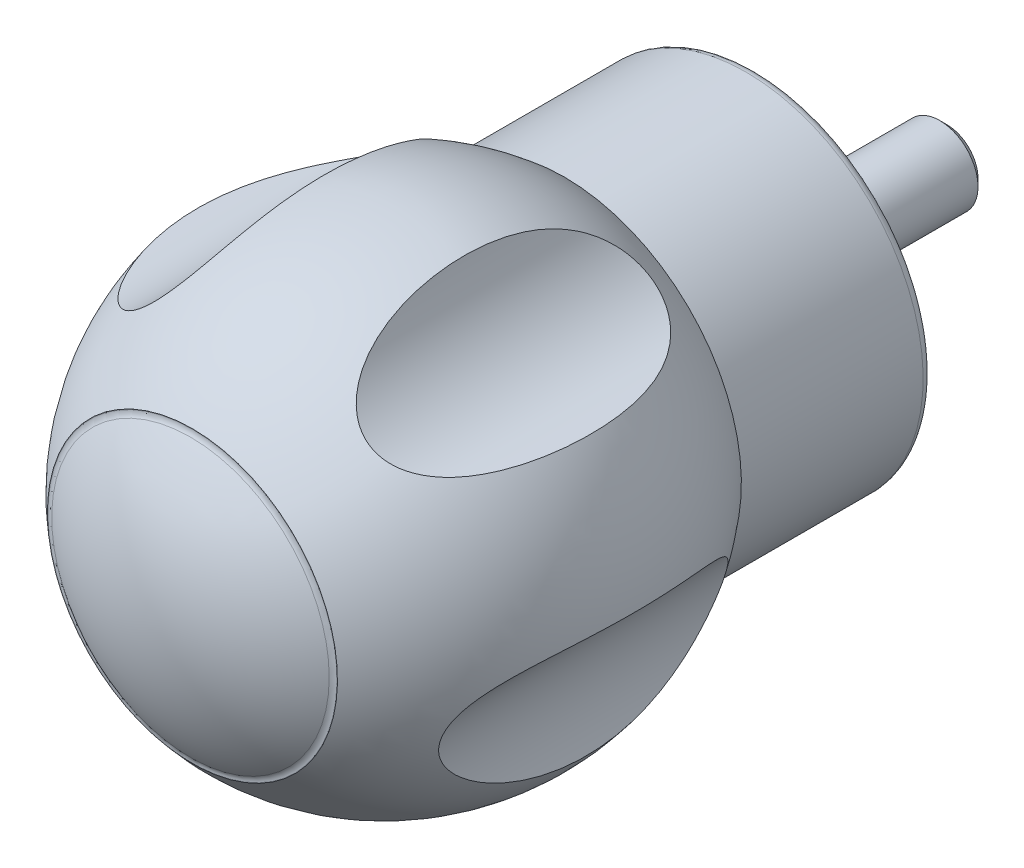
ISO-10303-21;
HEADER;
FILE_DESCRIPTION(('STEP AP214'),'2;1');
FILE_NAME('part.step','',(''),(''),'','','');
FILE_SCHEMA(('AUTOMOTIVE_DESIGN { 1 0 10303 214 1 1 1 1 }'));
ENDSEC;
DATA;
#1=APPLICATION_CONTEXT('core data for automotive mechanical design processes');
#2=APPLICATION_PROTOCOL_DEFINITION('international standard','automotive_design',2000,#1);
#3=PRODUCT_CONTEXT('',#1,'mechanical');
#4=PRODUCT('Part','Part','',(#3));
#5=PRODUCT_RELATED_PRODUCT_CATEGORY('part','',(#4));
#6=PRODUCT_DEFINITION_FORMATION('','',#4);
#7=PRODUCT_DEFINITION_CONTEXT('part definition',#1,'design');
#8=PRODUCT_DEFINITION('design','',#6,#7);
#9=PRODUCT_DEFINITION_SHAPE('','',#8);
#10=(LENGTH_UNIT() NAMED_UNIT(*) SI_UNIT(.MILLI.,.METRE.));
#11=(NAMED_UNIT(*) PLANE_ANGLE_UNIT() SI_UNIT($,.RADIAN.));
#12=(NAMED_UNIT(*) SI_UNIT($,.STERADIAN.) SOLID_ANGLE_UNIT());
#13=UNCERTAINTY_MEASURE_WITH_UNIT(LENGTH_MEASURE(1.E-05),#10,'distance_accuracy_value','');
#14=(GEOMETRIC_REPRESENTATION_CONTEXT(3) GLOBAL_UNCERTAINTY_ASSIGNED_CONTEXT((#13)) GLOBAL_UNIT_ASSIGNED_CONTEXT((#10,
#11,#12)) REPRESENTATION_CONTEXT('',''));
#15=CARTESIAN_POINT('',(0.,0.,0.));
#16=DIRECTION('',(0.,0.,1.));
#17=DIRECTION('',(1.,0.,0.));
#18=AXIS2_PLACEMENT_3D('',#15,#16,#17);
#19=CARTESIAN_POINT('',(0.,0.,0.));
#20=DIRECTION('',(0.,0.,-1.));
#21=DIRECTION('',(0.,1.,0.));
#22=AXIS2_PLACEMENT_3D('',#19,#20,#21);
#23=PLANE('',#22);
#24=CARTESIAN_POINT('',(0.,0.,0.));
#25=DIRECTION('',(0.,0.,-1.));
#26=DIRECTION('',(0.,1.,0.));
#27=AXIS2_PLACEMENT_3D('',#24,#25,#26);
#28=CIRCLE('',#27,4.);
#29=CARTESIAN_POINT('',(0.,4.,0.));
#30=VERTEX_POINT('',#29);
#31=EDGE_CURVE('E8',#30,#30,#28,.T.);
#32=ORIENTED_EDGE('',*,*,#31,.F.);
#33=EDGE_LOOP('',(#32));
#34=FACE_BOUND('',#33,.T.);
#35=CARTESIAN_POINT('',(0.,0.,0.));
#36=DIRECTION('',(0.,0.,-1.));
#37=DIRECTION('',(0.,1.,0.));
#38=AXIS2_PLACEMENT_3D('',#35,#36,#37);
#39=CIRCLE('',#38,17.5);
#40=CARTESIAN_POINT('',(0.,17.5,0.));
#41=VERTEX_POINT('',#40);
#42=EDGE_CURVE('E18',#41,#41,#39,.T.);
#43=ORIENTED_EDGE('',*,*,#42,.T.);
#44=EDGE_LOOP('',(#43));
#45=FACE_BOUND('',#44,.T.);
#46=ADVANCED_FACE('F12',(#34,#45),#23,.T.);
#47=CARTESIAN_POINT('',(0.,0.,0.999999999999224));
#48=DIRECTION('',(0.,0.,-1.));
#49=DIRECTION('',(0.,1.,0.));
#50=AXIS2_PLACEMENT_3D('',#47,#48,#49);
#51=TOROIDAL_SURFACE('',#50,17.5000000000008,0.999999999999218);
#52=CARTESIAN_POINT('',(0.,0.,1.));
#53=DIRECTION('',(0.,0.,-1.));
#54=DIRECTION('',(0.,1.,0.));
#55=AXIS2_PLACEMENT_3D('',#52,#53,#54);
#56=CIRCLE('',#55,18.5);
#57=CARTESIAN_POINT('',(0.,18.5,1.));
#58=VERTEX_POINT('',#57);
#59=EDGE_CURVE('E22',#58,#58,#56,.T.);
#60=ORIENTED_EDGE('',*,*,#59,.T.);
#61=EDGE_LOOP('',(#60));
#62=FACE_BOUND('',#61,.T.);
#63=ORIENTED_EDGE('',*,*,#42,.F.);
#64=EDGE_LOOP('',(#63));
#65=FACE_BOUND('',#64,.T.);
#66=ADVANCED_FACE('F120',(#62,#65),#51,.T.);
#67=CARTESIAN_POINT('',(0.,0.,64.));
#68=DIRECTION('',(0.,0.,-1.));
#69=DIRECTION('',(0.,1.,0.));
#70=AXIS2_PLACEMENT_3D('',#67,#68,#69);
#71=CYLINDRICAL_SURFACE('',#70,18.5);
#72=CARTESIAN_POINT('',(0.,0.,20.));
#73=DIRECTION('',(0.,0.,-1.));
#74=DIRECTION('',(0.,1.,0.));
#75=AXIS2_PLACEMENT_3D('',#72,#73,#74);
#76=CIRCLE('',#75,18.5);
#77=CARTESIAN_POINT('',(0.,18.5,20.));
#78=VERTEX_POINT('',#77);
#79=EDGE_CURVE('E27',#78,#78,#76,.T.);
#80=ORIENTED_EDGE('',*,*,#79,.T.);
#81=EDGE_LOOP('',(#80));
#82=FACE_BOUND('',#81,.T.);
#83=ORIENTED_EDGE('',*,*,#59,.F.);
#84=EDGE_LOOP('',(#83));
#85=FACE_BOUND('',#84,.T.);
#86=ADVANCED_FACE('F106',(#82,#85),#71,.T.);
#87=CARTESIAN_POINT('',(0.,0.,37.7823040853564));
#88=DIRECTION('',(0.,0.,-1.));
#89=DIRECTION('',(0.,1.,0.));
#90=AXIS2_PLACEMENT_3D('',#87,#88,#89);
#91=DEGENERATE_TOROIDAL_SURFACE('',#90,2.45981194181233,27.4867978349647,.F.);
#92=CARTESIAN_POINT('',(9.64615552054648,19.1331819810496,24.1833184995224));
#93=CARTESIAN_POINT('',(9.48345657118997,19.3402419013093,24.3794324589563));
#94=CARTESIAN_POINT('',(9.3348650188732,19.5426746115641,24.5920665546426));
#95=CARTESIAN_POINT('',(9.06234425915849,19.9357170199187,25.0428562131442));
#96=CARTESIAN_POINT('',(8.93845436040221,20.1263075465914,25.2810515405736));
#97=CARTESIAN_POINT('',(8.71118421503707,20.4952338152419,25.7786146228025));
#98=CARTESIAN_POINT('',(8.60794571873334,20.6734797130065,26.0381125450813));
#99=CARTESIAN_POINT('',(8.41968766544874,21.0155888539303,26.5724184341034));
#100=CARTESIAN_POINT('',(8.33466135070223,21.1794574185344,26.8472206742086));
#101=CARTESIAN_POINT('',(8.14928092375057,21.5544472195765,27.5198032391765));
#102=CARTESIAN_POINT('',(8.05609382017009,21.7587365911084,27.9233650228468));
#103=CARTESIAN_POINT('',(7.89274210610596,22.1392008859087,28.7480367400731));
#104=CARTESIAN_POINT('',(7.8225900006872,22.3153605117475,29.1691560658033));
#105=CARTESIAN_POINT('',(7.70040655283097,22.6396177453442,30.023843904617));
#106=CARTESIAN_POINT('',(7.64835011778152,22.787754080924,30.4573942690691));
#107=CARTESIAN_POINT('',(7.5583515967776,23.0566849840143,31.3342431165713));
#108=CARTESIAN_POINT('',(7.52040841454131,23.1774816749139,31.7775408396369));
#109=CARTESIAN_POINT('',(7.46554169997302,23.359526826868,32.5355594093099));
#110=CARTESIAN_POINT('',(7.44573424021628,23.4277178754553,32.8484350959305));
#111=CARTESIAN_POINT('',(7.41078752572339,23.5511669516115,33.4770140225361));
#112=CARTESIAN_POINT('',(7.39564860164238,23.6064240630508,33.7927174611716));
#113=CARTESIAN_POINT('',(7.36943118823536,23.7041033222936,34.4263549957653));
#114=CARTESIAN_POINT('',(7.35835379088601,23.7465220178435,34.744289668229));
#115=CARTESIAN_POINT('',(7.33982062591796,23.8185798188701,35.3817210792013));
#116=CARTESIAN_POINT('',(7.3323652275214,23.8482176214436,35.7012179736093));
#117=CARTESIAN_POINT('',(7.31489793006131,23.9181580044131,36.662895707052));
#118=CARTESIAN_POINT('',(7.30984724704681,23.9392423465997,37.3066647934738));
#119=CARTESIAN_POINT('',(7.31201499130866,23.930357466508,38.5937099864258));
#120=CARTESIAN_POINT('',(7.3192310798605,23.9003979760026,39.2369861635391));
#121=CARTESIAN_POINT('',(7.34031673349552,23.8167327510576,40.2018959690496));
#122=CARTESIAN_POINT('',(7.34913632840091,23.7820772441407,40.5253890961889));
#123=CARTESIAN_POINT('',(7.37065082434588,23.6995982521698,41.1705501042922));
#124=CARTESIAN_POINT('',(7.38334530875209,23.6517761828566,41.4922181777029));
#125=CARTESIAN_POINT('',(7.41313830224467,23.5428498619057,42.1332804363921));
#126=CARTESIAN_POINT('',(7.4302392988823,23.4817381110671,42.4526732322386));
#127=CARTESIAN_POINT('',(7.46953672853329,23.346142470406,43.0882937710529));
#128=CARTESIAN_POINT('',(7.49173305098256,23.2716588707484,43.4045215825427));
#129=CARTESIAN_POINT('',(7.54196498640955,23.1096128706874,44.0313942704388));
#130=CARTESIAN_POINT('',(7.56996980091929,23.0221201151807,44.3420595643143));
#131=CARTESIAN_POINT('',(7.63295092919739,22.8336259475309,44.9585946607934));
#132=CARTESIAN_POINT('',(7.66792784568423,22.7326233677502,45.2644640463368));
#133=CARTESIAN_POINT('',(7.74609493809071,22.5170918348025,45.8699523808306));
#134=CARTESIAN_POINT('',(7.78927572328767,22.4025784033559,46.1695780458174));
#135=CARTESIAN_POINT('',(7.88540878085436,22.1598219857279,46.7615525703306));
#136=CARTESIAN_POINT('',(7.93835812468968,22.0315831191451,47.0539035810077));
#137=CARTESIAN_POINT('',(8.04334062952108,21.7901126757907,47.568273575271));
#138=CARTESIAN_POINT('',(8.09315689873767,21.6795205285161,47.7919850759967));
#139=CARTESIAN_POINT('',(8.2010375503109,21.4497580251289,48.2329104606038));
#140=CARTESIAN_POINT('',(8.25910080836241,21.3305888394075,48.4501252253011));
#141=CARTESIAN_POINT('',(8.3847913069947,21.0834789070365,48.8772303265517));
#142=CARTESIAN_POINT('',(8.45243513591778,20.9555231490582,49.0871071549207));
#143=CARTESIAN_POINT('',(8.59858161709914,20.6911498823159,49.4975980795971));
#144=CARTESIAN_POINT('',(8.67708445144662,20.5547322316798,49.6982120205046));
#145=CARTESIAN_POINT('',(8.84769419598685,20.2716944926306,50.0910311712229));
#146=CARTESIAN_POINT('',(8.93998001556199,20.1249561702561,50.283074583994));
#147=CARTESIAN_POINT('',(9.13905119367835,19.8235620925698,50.6531080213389));
#148=CARTESIAN_POINT('',(9.24584025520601,19.6689043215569,50.831094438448));
#149=CARTESIAN_POINT('',(9.47526528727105,19.3532201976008,51.1690858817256));
#150=CARTESIAN_POINT('',(9.5978411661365,19.1922195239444,51.3291549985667));
#151=CARTESIAN_POINT('',(9.86055062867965,18.8650643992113,51.6279005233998));
#152=CARTESIAN_POINT('',(10.0006666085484,18.698915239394,51.7665980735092));
#153=CARTESIAN_POINT('',(10.3189452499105,18.3420469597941,52.034220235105));
#154=CARTESIAN_POINT('',(10.4996818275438,18.1509018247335,52.1596296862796));
#155=CARTESIAN_POINT('',(10.7882432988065,17.8653559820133,52.3173260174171));
#156=CARTESIAN_POINT('',(10.8873535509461,17.7703573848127,52.3648259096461));
#157=CARTESIAN_POINT('',(11.0911138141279,17.5814933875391,52.4488653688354));
#158=CARTESIAN_POINT('',(11.1957612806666,17.4876274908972,52.4854099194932));
#159=CARTESIAN_POINT('',(11.4109272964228,17.3011546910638,52.547029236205));
#160=CARTESIAN_POINT('',(11.5214842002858,17.2085626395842,52.5720153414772));
#161=CARTESIAN_POINT('',(11.7469624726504,17.0262974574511,52.6095383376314));
#162=CARTESIAN_POINT('',(11.8618819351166,16.9366230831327,52.6220806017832));
#163=CARTESIAN_POINT('',(12.0952129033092,16.7610112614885,52.6344332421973));
#164=CARTESIAN_POINT('',(12.213624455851,16.675073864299,52.6342434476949));
#165=CARTESIAN_POINT('',(12.4528872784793,16.5076976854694,52.6211364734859));
#166=CARTESIAN_POINT('',(12.5737384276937,16.4262586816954,52.6082199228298));
#167=CARTESIAN_POINT('',(12.8055938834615,16.2757414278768,52.5717303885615));
#168=CARTESIAN_POINT('',(12.9164810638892,16.2062153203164,52.5492472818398));
#169=CARTESIAN_POINT('',(13.1385793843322,16.0716588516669,52.4944712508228));
#170=CARTESIAN_POINT('',(13.2497906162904,16.0066299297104,52.4621752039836));
#171=CARTESIAN_POINT('',(13.5827295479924,15.8186232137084,52.3513785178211));
#172=CARTESIAN_POINT('',(13.8038861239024,15.7026457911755,52.2589490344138));
#173=CARTESIAN_POINT('',(14.320248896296,15.450110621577,52.0022092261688));
#174=CARTESIAN_POINT('',(14.6125049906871,15.3218679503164,51.8239538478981));
#175=CARTESIAN_POINT('',(15.1772253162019,15.0968616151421,51.4218619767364));
#176=CARTESIAN_POINT('',(15.4496457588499,15.0001660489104,51.1979285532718));
#177=CARTESIAN_POINT('',(15.9069492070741,14.8535028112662,50.7756127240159));
#178=CARTESIAN_POINT('',(16.0968863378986,14.7978916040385,50.5844859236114));
#179=CARTESIAN_POINT('',(16.4633333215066,14.699129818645,50.1866432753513));
#180=CARTESIAN_POINT('',(16.6398361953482,14.6559856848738,49.9799194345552));
#181=CARTESIAN_POINT('',(16.9795964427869,14.5800076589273,49.5536597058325));
#182=CARTESIAN_POINT('',(17.1428342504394,14.5471887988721,49.3341056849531));
#183=CARTESIAN_POINT('',(17.4561371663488,14.4900636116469,48.8846930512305));
#184=CARTESIAN_POINT('',(17.6061977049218,14.465760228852,48.6548309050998));
#185=CARTESIAN_POINT('',(17.9868742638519,14.4104834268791,48.0345307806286));
#186=CARTESIAN_POINT('',(18.2064910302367,14.3854339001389,47.6367866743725));
#187=CARTESIAN_POINT('',(18.6128643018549,14.3481661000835,46.824233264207));
#188=CARTESIAN_POINT('',(18.7996003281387,14.3359557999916,46.4094135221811));
#189=CARTESIAN_POINT('',(19.1421520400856,14.3198933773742,45.5664949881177));
#190=CARTESIAN_POINT('',(19.2979273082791,14.3160521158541,45.1383796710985));
#191=CARTESIAN_POINT('',(19.5797908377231,14.3133116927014,44.2725635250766));
#192=CARTESIAN_POINT('',(19.7058818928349,14.3144120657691,43.8348636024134));
#193=CARTESIAN_POINT('',(19.8965253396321,14.3182934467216,43.0829226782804));
#194=CARTESIAN_POINT('',(19.9682474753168,14.3204809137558,42.7704677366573));
#195=CARTESIAN_POINT('',(20.0979520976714,14.3253342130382,42.1426951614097));
#196=CARTESIAN_POINT('',(20.1559336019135,14.3280000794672,41.8273773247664));
#197=CARTESIAN_POINT('',(20.2584423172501,14.3332555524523,41.1944730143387));
#198=CARTESIAN_POINT('',(20.3029657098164,14.3358451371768,40.8768859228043));
#199=CARTESIAN_POINT('',(20.3787485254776,14.3405408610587,40.2401174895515));
#200=CARTESIAN_POINT('',(20.4100065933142,14.3426469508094,39.9209359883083));
#201=CARTESIAN_POINT('',(20.4842130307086,14.3477811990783,38.9605812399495));
#202=CARTESIAN_POINT('',(20.5074047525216,14.3496131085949,38.3177751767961));
#203=CARTESIAN_POINT('',(20.5015908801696,14.3491769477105,37.0325236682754));
#204=CARTESIAN_POINT('',(20.4725953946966,14.3469096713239,36.3900781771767));
#205=CARTESIAN_POINT('',(20.3892363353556,14.3412565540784,35.4261568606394));
#206=CARTESIAN_POINT('',(20.3544771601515,14.33897637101,35.1028822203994));
#207=CARTESIAN_POINT('',(20.2712780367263,14.3340068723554,34.4581139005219));
#208=CARTESIAN_POINT('',(20.2228395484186,14.331317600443,34.1366200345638));
#209=CARTESIAN_POINT('',(20.1120162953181,14.3259866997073,33.4958601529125));
#210=CARTESIAN_POINT('',(20.0496237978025,14.3233450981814,33.1765954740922));
#211=CARTESIAN_POINT('',(19.9105983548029,14.3187268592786,32.5411744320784));
#212=CARTESIAN_POINT('',(19.8339657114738,14.3167502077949,32.2250180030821));
#213=CARTESIAN_POINT('',(19.6664947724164,14.3142459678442,31.59816542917));
#214=CARTESIAN_POINT('',(19.5757293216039,14.3137111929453,31.2874499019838));
#215=CARTESIAN_POINT('',(19.3792557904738,14.3150195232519,30.6707388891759));
#216=CARTESIAN_POINT('',(19.2735464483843,14.3168628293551,30.364743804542));
#217=CARTESIAN_POINT('',(19.0467867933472,14.3240841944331,29.7589039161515));
#218=CARTESIAN_POINT('',(18.9257536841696,14.3294583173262,29.4590526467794));
#219=CARTESIAN_POINT('',(18.667680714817,14.3451379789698,28.866510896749));
#220=CARTESIAN_POINT('',(18.5306455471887,14.3554420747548,28.5738183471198));
#221=CARTESIAN_POINT('',(18.2698206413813,14.3798794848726,28.0565192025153));
#222=CARTESIAN_POINT('',(18.1491118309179,14.3927877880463,27.8303006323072));
#223=CARTESIAN_POINT('',(17.8968255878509,14.4237999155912,27.3843837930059));
#224=CARTESIAN_POINT('',(17.7652496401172,14.4419030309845,27.1646846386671));
#225=CARTESIAN_POINT('',(17.4906228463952,14.4845139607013,26.7326331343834));
#226=CARTESIAN_POINT('',(17.3475519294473,14.5090331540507,26.5202946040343));
#227=CARTESIAN_POINT('',(17.0498212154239,14.5658261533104,26.1049313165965));
#228=CARTESIAN_POINT('',(16.8951612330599,14.5981000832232,25.9019067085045));
#229=CARTESIAN_POINT('',(16.5716975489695,14.6725075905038,25.5042749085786));
#230=CARTESIAN_POINT('',(16.4027212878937,14.7147773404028,25.3098324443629));
#231=CARTESIAN_POINT('',(16.0525323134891,14.8107759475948,24.9351177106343));
#232=CARTESIAN_POINT('',(15.8713163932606,14.8645078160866,24.7548491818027));
#233=CARTESIAN_POINT('',(15.4977153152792,14.9852344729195,24.4124922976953));
#234=CARTESIAN_POINT('',(15.3053750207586,15.0521783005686,24.2503377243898));
#235=CARTESIAN_POINT('',(14.9101396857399,15.2013886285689,23.9476798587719));
#236=CARTESIAN_POINT('',(14.7072556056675,15.2836394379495,23.8071546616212));
#237=CARTESIAN_POINT('',(14.2677894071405,15.4762585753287,23.5371657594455));
#238=CARTESIAN_POINT('',(14.0300690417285,15.5888074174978,23.4110046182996));
#239=CARTESIAN_POINT('',(13.6691228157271,15.7746252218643,23.2521491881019));
#240=CARTESIAN_POINT('',(13.5480644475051,15.839406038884,23.204257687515));
#241=CARTESIAN_POINT('',(13.3052834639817,15.9746013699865,23.1194301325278));
#242=CARTESIAN_POINT('',(13.1835611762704,16.0450133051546,23.0824890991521));
#243=CARTESIAN_POINT('',(12.9394612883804,16.1918335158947,23.0200747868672));
#244=CARTESIAN_POINT('',(12.8170857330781,16.2682832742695,22.9946907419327));
#245=CARTESIAN_POINT('',(12.5737336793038,16.4262595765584,22.9563831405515));
#246=CARTESIAN_POINT('',(12.4527565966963,16.5077839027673,22.9434541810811));
#247=CARTESIAN_POINT('',(12.2132400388,16.6753479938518,22.9303540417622));
#248=CARTESIAN_POINT('',(12.0947006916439,16.761387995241,22.9301835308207));
#249=CARTESIAN_POINT('',(11.8611503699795,16.937182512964,22.9425849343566));
#250=CARTESIAN_POINT('',(11.7461391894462,17.026936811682,22.955156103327));
#251=CARTESIAN_POINT('',(11.4286566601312,17.2836473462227,23.0081332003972));
#252=CARTESIAN_POINT('',(11.2311540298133,17.4540059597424,23.0628637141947));
#253=CARTESIAN_POINT('',(10.8547688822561,17.798819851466,23.2095558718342));
#254=CARTESIAN_POINT('',(10.6758911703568,17.9732761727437,23.3015270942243));
#255=CARTESIAN_POINT('',(10.3454340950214,18.3141897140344,23.5125503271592));
#256=CARTESIAN_POINT('',(10.1930118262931,18.4806684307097,23.6302683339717));
#257=CARTESIAN_POINT('',(9.9063000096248,18.8100812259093,23.8898050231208));
#258=CARTESIAN_POINT('',(9.77200724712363,18.9730159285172,24.0316194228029));
#259=CARTESIAN_POINT('',(9.64615552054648,19.1331819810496,24.1833184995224));
#260=B_SPLINE_CURVE_WITH_KNOTS('',3,(#92,#93,#94,#95,#96,#97,#98,#99,#100,#101,#102,#103,#104,
#105,#106,#107,#108,#109,#110,#111,#112,#113,#114,#115,#116,#117,#118,#119,#120,#121,#122,#123,
#124,#125,#126,#127,#128,#129,#130,#131,#132,#133,#134,#135,#136,#137,#138,#139,#140,#141,#142,
#143,#144,#145,#146,#147,#148,#149,#150,#151,#152,#153,#154,#155,#156,#157,#158,#159,#160,#161,
#162,#163,#164,#165,#166,#167,#168,#169,#170,#171,#172,#173,#174,#175,#176,#177,#178,#179,#180,
#181,#182,#183,#184,#185,#186,#187,#188,#189,#190,#191,#192,#193,#194,#195,#196,#197,#198,#199,
#200,#201,#202,#203,#204,#205,#206,#207,#208,#209,#210,#211,#212,#213,#214,#215,#216,#217,#218,
#219,#220,#221,#222,#223,#224,#225,#226,#227,#228,#229,#230,#231,#232,#233,#234,#235,#236,#237,
#238,#239,#240,#241,#242,#243,#244,#245,#246,#247,#248,#249,#250,#251,#252,#253,#254,#255,#256,
#257,#258,#259),.UNSPECIFIED.,.T.,.F.,(4,2,2,2,2,2,2,2,2,2,2,2,2,2,2,2,2,2,2,2,2,2,2,2,2,2,2,2,
2,2,2,2,2,2,2,2,2,2,2,2,2,2,2,2,2,2,2,2,2,2,2,2,2,2,2,2,2,2,2,2,2,2,2,2,2,2,2,2,2,2,2,2,2,2,2,2,
2,2,2,2,2,2,2,4),(0.,0.984470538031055,1.97049541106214,2.96307211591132,3.95527987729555,
5.33855218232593,6.72257419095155,8.10466929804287,9.4866570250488,10.4488665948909,
11.4111442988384,12.3736805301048,13.3363148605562,15.2664246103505,17.1961664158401,
18.1723123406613,19.1483533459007,20.1249465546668,21.1015185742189,22.07303913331,
23.0446437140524,24.0151427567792,24.9853513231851,25.7484674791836,26.5114796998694,
27.2758295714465,28.0401922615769,28.8155138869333,29.5910338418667,30.3636845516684,
31.1355659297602,32.0061083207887,32.4414898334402,32.8766729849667,33.3151410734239,
33.7534197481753,34.1917043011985,34.6299671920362,35.0279045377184,35.4259686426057,
36.2216565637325,37.3123882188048,38.4054589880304,39.22976871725,40.0545037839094,
40.8804340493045,41.7066496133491,43.0696147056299,44.4334257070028,45.7990055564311,
47.1644568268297,48.1259320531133,49.0874760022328,50.0492925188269,51.0112072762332,
52.9386033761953,54.8656261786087,55.8408202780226,56.815910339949,57.7915421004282,
58.7671531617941,59.7378926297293,60.7087141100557,61.678455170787,62.6479125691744,
63.417790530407,64.1875634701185,64.9587109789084,65.7298708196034,66.5122118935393,
67.2947587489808,68.0743441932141,68.8531348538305,69.7245362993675,70.1603455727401,
70.5959563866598,71.0348758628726,71.4736048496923,71.9123568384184,72.3510831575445,
73.1467362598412,73.9425941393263,74.7042420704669,75.4657547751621),.UNSPECIFIED.);
#261=CARTESIAN_POINT('',(9.64615552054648,19.1331819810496,24.1833184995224));
#262=VERTEX_POINT('',#261);
#263=EDGE_CURVE('E83',#262,#262,#260,.T.);
#264=ORIENTED_EDGE('',*,*,#263,.F.);
#265=EDGE_LOOP('',(#264));
#266=FACE_BOUND('',#265,.T.);
#267=CARTESIAN_POINT('',(19.0721852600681,-11.1680952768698,25.4426161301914));
#268=CARTESIAN_POINT('',(19.0623640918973,-11.0283355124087,25.2851801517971));
#269=CARTESIAN_POINT('',(19.0545384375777,-10.8837357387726,25.1318868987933));
#270=CARTESIAN_POINT('',(19.0438547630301,-10.5846503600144,24.8351316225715));
#271=CARTESIAN_POINT('',(19.0409972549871,-10.4301637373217,24.691670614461));
#272=CARTESIAN_POINT('',(19.0415090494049,-9.95209015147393,24.2791378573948));
#273=CARTESIAN_POINT('',(19.0538954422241,-9.61310588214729,24.0270115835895));
#274=CARTESIAN_POINT('',(19.1041865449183,-8.99900634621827,23.6497700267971));
#275=CARTESIAN_POINT('',(19.1338737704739,-8.73297996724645,23.5089050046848));
#276=CARTESIAN_POINT('',(19.1938752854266,-8.32262867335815,23.3287295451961));
#277=CARTESIAN_POINT('',(19.2164603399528,-8.18393056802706,23.2738501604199));
#278=CARTESIAN_POINT('',(19.267080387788,-7.90355872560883,23.1754616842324));
#279=CARTESIAN_POINT('',(19.2951129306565,-7.76188635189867,23.1319475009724));
#280=CARTESIAN_POINT('',(19.357082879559,-7.47527231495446,23.0568566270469));
#281=CARTESIAN_POINT('',(19.3910701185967,-7.33031284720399,23.0253884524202));
#282=CARTESIAN_POINT('',(19.4647864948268,-7.03957276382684,22.9756795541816));
#283=CARTESIAN_POINT('',(19.5045155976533,-6.89379215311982,22.9574387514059));
#284=CARTESIAN_POINT('',(19.5895057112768,-6.60284514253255,22.9346551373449));
#285=CARTESIAN_POINT('',(19.6347640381,-6.45767847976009,22.9301057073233));
#286=CARTESIAN_POINT('',(19.7304375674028,-6.16929121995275,22.9348062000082));
#287=CARTESIAN_POINT('',(19.780852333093,-6.02607045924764,22.9440549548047));
#288=CARTESIAN_POINT('',(19.8798541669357,-5.76014382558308,22.9741532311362));
#289=CARTESIAN_POINT('',(19.9279160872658,-5.63706374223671,22.9934527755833));
#290=CARTESIAN_POINT('',(20.0271323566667,-5.39416709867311,23.0421227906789));
#291=CARTESIAN_POINT('',(20.0782876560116,-5.27435155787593,23.0714963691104));
#292=CARTESIAN_POINT('',(20.2356369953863,-4.92085237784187,23.1739727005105));
#293=CARTESIAN_POINT('',(20.3457684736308,-4.6929725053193,23.2614481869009));
#294=CARTESIAN_POINT('',(20.6101862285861,-4.18352994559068,23.5040625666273));
#295=CARTESIAN_POINT('',(20.7669386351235,-3.90944430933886,23.6720412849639));
#296=CARTESIAN_POINT('',(21.0837421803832,-3.39692062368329,24.0533196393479));
#297=CARTESIAN_POINT('',(21.2437993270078,-3.15855548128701,24.266709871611));
#298=CARTESIAN_POINT('',(21.5210545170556,-2.77180192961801,24.6689738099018));
#299=CARTESIAN_POINT('',(21.6388543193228,-2.61590410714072,24.8503989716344));
#300=CARTESIAN_POINT('',(21.8714595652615,-2.32137372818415,25.2286598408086));
#301=CARTESIAN_POINT('',(21.9862634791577,-2.18274986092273,25.4255032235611));
#302=CARTESIAN_POINT('',(22.2117703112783,-1.92107852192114,25.8319054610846));
#303=CARTESIAN_POINT('',(22.3224670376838,-1.79805394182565,26.0414823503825));
#304=CARTESIAN_POINT('',(22.538766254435,-1.5662031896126,26.4709068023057));
#305=CARTESIAN_POINT('',(22.6443669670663,-1.45738195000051,26.6907578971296));
#306=CARTESIAN_POINT('',(22.9164150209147,-1.18608106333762,27.2841896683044));
#307=CARTESIAN_POINT('',(23.0779389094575,-1.03453662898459,27.6650536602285));
#308=CARTESIAN_POINT('',(23.3834716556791,-0.76045920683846,28.4439005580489));
#309=CARTESIAN_POINT('',(23.5274695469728,-0.637944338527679,28.8418939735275));
#310=CARTESIAN_POINT('',(23.7968925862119,-0.417328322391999,29.6513113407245));
#311=CARTESIAN_POINT('',(23.9222912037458,-0.31926191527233,30.0627534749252));
#312=CARTESIAN_POINT('',(24.1534746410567,-0.144173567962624,30.8954130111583));
#313=CARTESIAN_POINT('',(24.2592612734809,-0.0671496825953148,31.3166295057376));
#314=CARTESIAN_POINT('',(24.4238467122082,0.0496019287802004,32.047227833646));
#315=CARTESIAN_POINT('',(24.4875023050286,0.0937309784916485,32.3548380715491));
#316=CARTESIAN_POINT('',(24.6042630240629,0.173368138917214,32.973190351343));
#317=CARTESIAN_POINT('',(24.6573673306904,0.208875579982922,33.2839326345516));
#318=CARTESIAN_POINT('',(24.7529207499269,0.271939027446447,33.9079408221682));
#319=CARTESIAN_POINT('',(24.7953666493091,0.29949263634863,34.2212074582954));
#320=CARTESIAN_POINT('',(24.8695059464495,0.347151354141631,34.849603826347));
#321=CARTESIAN_POINT('',(24.9011982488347,0.367255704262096,35.1647337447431));
#322=CARTESIAN_POINT('',(24.9538094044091,0.4004149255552,35.7967783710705));
#323=CARTESIAN_POINT('',(24.9747105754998,0.41345822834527,36.1136951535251));
#324=CARTESIAN_POINT('',(25.0056258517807,0.432690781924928,36.7482953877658));
#325=CARTESIAN_POINT('',(25.0156389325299,0.438879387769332,37.0659789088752));
#326=CARTESIAN_POINT('',(25.0247561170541,0.444515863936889,37.701486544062));
#327=CARTESIAN_POINT('',(25.0238628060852,0.443965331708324,38.0193106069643));
#328=CARTESIAN_POINT('',(25.0111750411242,0.436117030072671,38.6546576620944));
#329=CARTESIAN_POINT('',(24.9993805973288,0.4288192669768,38.9721806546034));
#330=CARTESIAN_POINT('',(24.9646664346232,0.407187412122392,39.6109021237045));
#331=CARTESIAN_POINT('',(24.9415913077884,0.392754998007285,39.9320888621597));
#332=CARTESIAN_POINT('',(24.8842948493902,0.35653347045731,40.5730139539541));
#333=CARTESIAN_POINT('',(24.8500748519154,0.334745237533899,40.8927524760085));
#334=CARTESIAN_POINT('',(24.770531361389,0.28337778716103,41.5303953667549));
#335=CARTESIAN_POINT('',(24.7252019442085,0.253794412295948,41.8482986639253));
#336=CARTESIAN_POINT('',(24.6235459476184,0.186275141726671,42.4814152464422));
#337=CARTESIAN_POINT('',(24.5672207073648,0.148340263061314,42.7966288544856));
#338=CARTESIAN_POINT('',(24.4439137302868,0.0635358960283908,43.4225619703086));
#339=CARTESIAN_POINT('',(24.3769710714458,0.0166990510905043,43.7332935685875));
#340=CARTESIAN_POINT('',(24.2324546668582,-0.0868896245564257,44.3505654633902));
#341=CARTESIAN_POINT('',(24.154882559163,-0.143639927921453,44.657106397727));
#342=CARTESIAN_POINT('',(23.9893767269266,-0.268104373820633,45.264857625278));
#343=CARTESIAN_POINT('',(23.9014515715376,-0.335809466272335,45.5660720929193));
#344=CARTESIAN_POINT('',(23.7154832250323,-0.483512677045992,46.1622480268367));
#345=CARTESIAN_POINT('',(23.6174424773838,-0.563507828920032,46.45721098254));
#346=CARTESIAN_POINT('',(23.4257259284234,-0.725434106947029,46.9996108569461));
#347=CARTESIAN_POINT('',(23.3332965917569,-0.80559397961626,47.248016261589));
#348=CARTESIAN_POINT('',(23.1414992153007,-0.977402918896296,47.738084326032));
#349=CARTESIAN_POINT('',(23.042131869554,-1.0690508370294,47.9797476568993));
#350=CARTESIAN_POINT('',(22.836865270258,-1.2651914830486,48.4550245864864));
#351=CARTESIAN_POINT('',(22.7309652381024,-1.36968574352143,48.6886372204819));
#352=CARTESIAN_POINT('',(22.5132257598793,-1.5930227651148,49.1460594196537));
#353=CARTESIAN_POINT('',(22.4013870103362,-1.71186384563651,49.3698701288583));
#354=CARTESIAN_POINT('',(22.1901963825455,-1.94603320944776,49.771941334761));
#355=CARTESIAN_POINT('',(22.0915743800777,-2.05908329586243,49.9519081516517));
#356=CARTESIAN_POINT('',(21.8912959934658,-2.29775849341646,50.3016081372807));
#357=CARTESIAN_POINT('',(21.7896393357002,-2.42338474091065,50.4713403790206));
#358=CARTESIAN_POINT('',(21.5843567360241,-2.68806499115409,50.7981776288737));
#359=CARTESIAN_POINT('',(21.4807348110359,-2.82709356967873,50.9553055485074));
#360=CARTESIAN_POINT('',(21.2725598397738,-3.11965882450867,51.2546655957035));
#361=CARTESIAN_POINT('',(21.1680069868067,-3.27319254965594,51.3969007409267));
#362=CARTESIAN_POINT('',(20.9242857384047,-3.64993770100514,51.7083703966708));
#363=CARTESIAN_POINT('',(20.7852831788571,-3.87923401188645,51.8706322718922));
#364=CARTESIAN_POINT('',(20.581320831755,-4.24337798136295,52.08338385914));
#365=CARTESIAN_POINT('',(20.5140777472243,-4.36815194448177,52.1492039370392));
#366=CARTESIAN_POINT('',(20.3818256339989,-4.62414700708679,52.2695153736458));
#367=CARTESIAN_POINT('',(20.3168154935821,-4.75536481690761,52.3240124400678));
#368=CARTESIAN_POINT('',(20.1891131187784,-5.02518084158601,52.4211148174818));
#369=CARTESIAN_POINT('',(20.1264539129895,-5.1638439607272,52.4635838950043));
#370=CARTESIAN_POINT('',(20.0050835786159,-5.44625718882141,52.5348095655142));
#371=CARTESIAN_POINT('',(19.9463703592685,-5.5900045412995,52.5635734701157));
#372=CARTESIAN_POINT('',(19.8336837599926,-5.88139098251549,52.6066569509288));
#373=CARTESIAN_POINT('',(19.779707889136,-6.02902797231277,52.6209841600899));
#374=CARTESIAN_POINT('',(19.6771442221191,-6.32683662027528,52.6348208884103));
#375=CARTESIAN_POINT('',(19.6285557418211,-6.47700795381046,52.6343322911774));
#376=CARTESIAN_POINT('',(19.5436532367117,-6.75723229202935,52.6196633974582));
#377=CARTESIAN_POINT('',(19.5065731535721,-6.88715799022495,52.607409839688));
#378=CARTESIAN_POINT('',(19.4369248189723,-7.14678746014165,52.5722284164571));
#379=CARTESIAN_POINT('',(19.4043578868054,-7.27649115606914,52.5492974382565));
#380=CARTESIAN_POINT('',(19.3135579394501,-7.66382691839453,52.4651006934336));
#381=CARTESIAN_POINT('',(19.2621768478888,-7.91984661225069,52.3884218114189));
#382=CARTESIAN_POINT('',(19.1660350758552,-8.48522658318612,52.1749375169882));
#383=CARTESIAN_POINT('',(19.1263358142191,-8.79146523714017,52.027765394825));
#384=CARTESIAN_POINT('',(19.0700867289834,-9.38041135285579,51.6886082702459));
#385=CARTESIAN_POINT('',(19.0535777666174,-9.66307645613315,51.4965448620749));
#386=CARTESIAN_POINT('',(19.0405665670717,-10.1295722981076,51.1346277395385));
#387=CARTESIAN_POINT('',(19.0398828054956,-10.3195626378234,50.9726561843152));
#388=CARTESIAN_POINT('',(19.0462252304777,-10.6856064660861,50.6336861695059));
#389=CARTESIAN_POINT('',(19.0532550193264,-10.8616534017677,50.4566807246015));
#390=CARTESIAN_POINT('',(19.0733427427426,-11.2002791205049,50.0901686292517));
#391=CARTESIAN_POINT('',(19.0864092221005,-11.3628384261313,49.9006445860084));
#392=CARTESIAN_POINT('',(19.117108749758,-11.6748367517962,49.5114023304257));
#393=CARTESIAN_POINT('',(19.1347433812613,-11.8242711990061,49.3116806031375));
#394=CARTESIAN_POINT('',(19.1856441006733,-12.202226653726,48.7733353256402));
#395=CARTESIAN_POINT('',(19.2216949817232,-12.4202162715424,48.4275565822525));
#396=CARTESIAN_POINT('',(19.2981940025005,-12.825499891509,47.7188879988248));
#397=CARTESIAN_POINT('',(19.3386448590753,-13.0127747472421,47.3559876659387));
#398=CARTESIAN_POINT('',(19.4206221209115,-13.35943497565,46.6165314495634));
#399=CARTESIAN_POINT('',(19.4621502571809,-13.5187718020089,46.2399531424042));
#400=CARTESIAN_POINT('',(19.5435868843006,-13.8113796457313,45.4767269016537));
#401=CARTESIAN_POINT('',(19.5834955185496,-13.9446529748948,45.0900798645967));
#402=CARTESIAN_POINT('',(19.6501579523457,-14.1566882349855,44.4066290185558));
#403=CARTESIAN_POINT('',(19.6777064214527,-14.2407488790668,44.1115260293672));
#404=CARTESIAN_POINT('',(19.7300953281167,-14.3958988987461,43.5176637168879));
#405=CARTESIAN_POINT('',(19.7549355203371,-14.4669870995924,43.2189040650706));
#406=CARTESIAN_POINT('',(19.8013565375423,-14.5967402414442,42.6183481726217));
#407=CARTESIAN_POINT('',(19.8229362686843,-14.6554010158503,42.3165509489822));
#408=CARTESIAN_POINT('',(19.8623907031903,-14.7607054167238,41.7106150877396));
#409=CARTESIAN_POINT('',(19.8802650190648,-14.8073477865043,41.4064762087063));
#410=CARTESIAN_POINT('',(19.9277972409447,-14.9298115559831,40.4911627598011));
#411=CARTESIAN_POINT('',(19.9513523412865,-14.9881373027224,39.877243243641));
#412=CARTESIAN_POINT('',(19.980434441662,-15.0598279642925,38.6464982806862));
#413=CARTESIAN_POINT('',(19.98596455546,-15.0732006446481,38.0296733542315));
#414=CARTESIAN_POINT('',(19.9804674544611,-15.059744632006,37.0990523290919));
#415=CARTESIAN_POINT('',(19.9762262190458,-15.0494054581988,36.7848898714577));
#416=CARTESIAN_POINT('',(19.9630675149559,-15.0170456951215,36.1572728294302));
#417=CARTESIAN_POINT('',(19.9541504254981,-14.9950260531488,35.8438181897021));
#418=CARTESIAN_POINT('',(19.9317957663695,-14.9391344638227,35.2180253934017));
#419=CARTESIAN_POINT('',(19.9183566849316,-14.9052585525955,34.9056876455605));
#420=CARTESIAN_POINT('',(19.8872163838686,-14.8254014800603,34.2828052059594));
#421=CARTESIAN_POINT('',(19.8695156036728,-14.7794215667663,33.9722603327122));
#422=CARTESIAN_POINT('',(19.8301819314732,-14.6749485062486,33.3531945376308));
#423=CARTESIAN_POINT('',(19.8085449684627,-14.6164423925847,33.0446760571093));
#424=CARTESIAN_POINT('',(19.7618132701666,-14.4864993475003,32.4306708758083));
#425=CARTESIAN_POINT('',(19.7367189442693,-14.4150639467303,32.1251838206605));
#426=CARTESIAN_POINT('',(19.6836570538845,-14.2587267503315,31.5180455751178));
#427=CARTESIAN_POINT('',(19.6556906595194,-14.1738304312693,31.2163928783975));
#428=CARTESIAN_POINT('',(19.5975967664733,-13.9898887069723,30.6176812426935));
#429=CARTESIAN_POINT('',(19.5674694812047,-13.8908446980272,30.3206218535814));
#430=CARTESIAN_POINT('',(19.4931147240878,-13.633529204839,29.6097093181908));
#431=CARTESIAN_POINT('',(19.4482286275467,-13.4677451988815,29.1985987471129));
#432=CARTESIAN_POINT('',(19.3589486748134,-13.1034501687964,28.3908356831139));
#433=CARTESIAN_POINT('',(19.3145550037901,-12.9049272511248,27.9941885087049));
#434=CARTESIAN_POINT('',(19.2306273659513,-12.4728645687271,27.2220747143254));
#435=CARTESIAN_POINT('',(19.1910708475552,-12.2394995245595,26.8465145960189));
#436=CARTESIAN_POINT('',(19.1394074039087,-11.8602414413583,26.3032059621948));
#437=CARTESIAN_POINT('',(19.1234698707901,-11.7290145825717,26.1255117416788));
#438=CARTESIAN_POINT('',(19.0950168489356,-11.4563347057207,25.7778951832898));
#439=CARTESIAN_POINT('',(19.0825004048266,-11.3148845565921,25.6079706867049));
#440=CARTESIAN_POINT('',(19.0721852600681,-11.1680952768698,25.4426161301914));
#441=B_SPLINE_CURVE_WITH_KNOTS('',3,(#267,#268,#269,#270,#271,#272,#273,#274,#275,#276,#277,
#278,#279,#280,#281,#282,#283,#284,#285,#286,#287,#288,#289,#290,#291,#292,#293,#294,#295,#296,
#297,#298,#299,#300,#301,#302,#303,#304,#305,#306,#307,#308,#309,#310,#311,#312,#313,#314,#315,
#316,#317,#318,#319,#320,#321,#322,#323,#324,#325,#326,#327,#328,#329,#330,#331,#332,#333,#334,
#335,#336,#337,#338,#339,#340,#341,#342,#343,#344,#345,#346,#347,#348,#349,#350,#351,#352,#353,
#354,#355,#356,#357,#358,#359,#360,#361,#362,#363,#364,#365,#366,#367,#368,#369,#370,#371,#372,
#373,#374,#375,#376,#377,#378,#379,#380,#381,#382,#383,#384,#385,#386,#387,#388,#389,#390,#391,
#392,#393,#394,#395,#396,#397,#398,#399,#400,#401,#402,#403,#404,#405,#406,#407,#408,#409,#410,
#411,#412,#413,#414,#415,#416,#417,#418,#419,#420,#421,#422,#423,#424,#425,#426,#427,#428,#429,
#430,#431,#432,#433,#434,#435,#436,#437,#438,#439,#440),.UNSPECIFIED.,.T.,.F.,(4,2,2,2,2,2,2,2,
2,2,2,2,2,2,2,2,2,2,2,2,2,2,2,2,2,2,2,2,2,2,2,2,2,2,2,2,2,2,2,2,2,2,2,2,2,2,2,2,2,2,2,2,2,2,2,2,
2,2,2,2,2,2,2,2,2,2,2,2,2,2,2,2,2,2,2,2,2,2,2,2,2,2,2,2,2,2,4),(0.,0.632111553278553,
1.26428826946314,2.52507796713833,3.42891741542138,3.88101915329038,4.33291799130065,
4.78879696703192,5.24467321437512,5.70032904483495,6.15594630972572,6.55607609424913,
6.95632942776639,7.75637833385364,8.82352779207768,9.89282651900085,10.6916909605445,
11.4909556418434,12.2913799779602,13.0920815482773,14.4117420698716,15.732224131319,
17.0545720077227,18.3767976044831,19.3281410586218,20.2795583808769,21.2312621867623,
22.183062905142,23.1364183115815,24.0898634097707,25.0430825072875,25.9963007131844,
26.9630375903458,27.9296587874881,28.8967965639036,29.8638166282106,30.8273567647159,
31.7907485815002,32.7533485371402,33.7157165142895,34.5460547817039,35.3763101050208,
36.2066645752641,37.0369218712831,37.7393011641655,38.4417439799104,39.1428795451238,
39.8438727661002,40.7802631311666,41.2486393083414,41.7167788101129,42.1900259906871,
42.6630204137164,43.1357646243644,43.6084487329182,44.0149459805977,44.4215618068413,
45.2342888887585,46.2550563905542,47.2776202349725,48.0256360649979,48.7740013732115,
49.5234292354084,50.2731171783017,51.5021937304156,52.732033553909,53.9639896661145,
55.1958364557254,56.1197669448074,57.0437810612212,57.9681044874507,58.8925245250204,
60.741830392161,62.5908167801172,63.5336888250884,64.4764844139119,65.4195955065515,
66.3626093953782,67.3066042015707,68.2504873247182,69.1939874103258,70.1373944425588,
71.4726853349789,72.8084623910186,74.1377530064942,74.8018436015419,75.4657485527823),.UNSPECIFIED.);
#442=CARTESIAN_POINT('',(19.0721852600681,-11.1680952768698,25.4426161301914));
#443=VERTEX_POINT('',#442);
#444=EDGE_CURVE('E78',#443,#443,#441,.T.);
#445=ORIENTED_EDGE('',*,*,#444,.F.);
#446=EDGE_LOOP('',(#445));
#447=FACE_BOUND('',#446,.T.);
#448=CARTESIAN_POINT('',(-4.39828338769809,-21.4619120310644,25.0647607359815));
#449=CARTESIAN_POINT('',(-4.14449352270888,-21.367454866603,24.7898352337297));
#450=CARTESIAN_POINT('',(-3.87234979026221,-21.2754235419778,24.5306716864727));
#451=CARTESIAN_POINT('',(-3.28916050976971,-21.1027408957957,24.0558665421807));
#452=CARTESIAN_POINT('',(-2.97817789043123,-21.022071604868,23.8401559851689));
#453=CARTESIAN_POINT('',(-2.39618792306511,-20.8970859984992,23.511441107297));
#454=CARTESIAN_POINT('',(-2.13308420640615,-20.8486836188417,23.3862121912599));
#455=CARTESIAN_POINT('',(-1.72478466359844,-20.7877529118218,23.2299049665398));
#456=CARTESIAN_POINT('',(-1.58639019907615,-20.7693863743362,23.1830541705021));
#457=CARTESIAN_POINT('',(-1.30578935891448,-20.7369971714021,23.1007222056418));
#458=CARTESIAN_POINT('',(-1.16358469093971,-20.7229725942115,23.0652360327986));
#459=CARTESIAN_POINT('',(-0.875236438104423,-20.6995730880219,23.0061634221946));
#460=CARTESIAN_POINT('',(-0.72907151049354,-20.6902332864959,22.9826668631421));
#461=CARTESIAN_POINT('',(-0.435003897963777,-20.6766460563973,22.9485202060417));
#462=CARTESIAN_POINT('',(-0.287101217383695,-20.672398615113,22.937870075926));
#463=CARTESIAN_POINT('',(0.00909543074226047,-20.6691336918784,22.9296815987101));
#464=CARTESIAN_POINT('',(0.157389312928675,-20.6701151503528,22.9321405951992));
#465=CARTESIAN_POINT('',(0.453048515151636,-20.6772736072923,22.9501025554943));
#466=CARTESIAN_POINT('',(0.600413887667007,-20.6834503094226,22.9656047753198));
#467=CARTESIAN_POINT('',(0.877539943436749,-20.6998880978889,23.006973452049));
#468=CARTESIAN_POINT('',(1.0075211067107,-20.709650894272,23.0315773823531));
#469=CARTESIAN_POINT('',(1.26494567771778,-20.732938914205,23.0904648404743));
#470=CARTESIAN_POINT('',(1.39238828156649,-20.7464653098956,23.1247513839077));
#471=CARTESIAN_POINT('',(1.76979609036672,-20.7922458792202,23.241284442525));
#472=CARTESIAN_POINT('',(2.01499230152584,-20.8297109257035,23.3372278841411));
#473=CARTESIAN_POINT('',(2.58178370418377,-20.9325649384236,23.6040279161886));
#474=CARTESIAN_POINT('',(2.89547736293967,-21.0031408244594,23.789506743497));
#475=CARTESIAN_POINT('',(3.48720697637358,-21.1578890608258,24.2062262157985));
#476=CARTESIAN_POINT('',(3.76516235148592,-21.2420912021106,24.4375673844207));
#477=CARTESIAN_POINT('',(4.22311572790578,-21.3963650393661,24.874007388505));
#478=CARTESIAN_POINT('',(4.4105712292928,-21.4649470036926,25.0719791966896));
#479=CARTESIAN_POINT('',(4.76670581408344,-21.6040763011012,25.4836324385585));
#480=CARTESIAN_POINT('',(4.93537497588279,-21.6746246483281,25.6973220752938));
#481=CARTESIAN_POINT('',(5.25545315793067,-21.8160142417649,26.137580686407));
#482=CARTESIAN_POINT('',(5.40683664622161,-21.8868557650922,26.3641679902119));
#483=CARTESIAN_POINT('',(5.6935353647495,-22.0273909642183,26.8276693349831));
#484=CARTESIAN_POINT('',(5.82884504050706,-22.0970842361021,27.0645869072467));
#485=CARTESIAN_POINT('',(6.16785540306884,-22.2787627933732,27.7035859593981));
#486=CARTESIAN_POINT('',(6.35887773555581,-22.3888085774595,28.112973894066));
#487=CARTESIAN_POINT('',(6.70604465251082,-22.5990750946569,28.9487545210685));
#488=CARTESIAN_POINT('',(6.86216759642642,-22.6992897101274,29.3751575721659));
#489=CARTESIAN_POINT('',(7.14382984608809,-22.8873835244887,30.2411132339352));
#490=CARTESIAN_POINT('',(7.26933185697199,-22.9752476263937,30.6806811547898));
#491=CARTESIAN_POINT('',(7.49283403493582,-23.1366018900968,31.5692511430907));
#492=CARTESIAN_POINT('',(7.59083682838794,-23.2100934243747,32.0182523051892));
#493=CARTESIAN_POINT('',(7.73565724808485,-23.3212237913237,32.7843988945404));
#494=CARTESIAN_POINT('',(7.78895529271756,-23.3629462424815,33.0997580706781));
#495=CARTESIAN_POINT('',(7.88421240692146,-23.4385058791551,33.7331510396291));
#496=CARTESIAN_POINT('',(7.92617071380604,-23.4723425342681,34.0511850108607));
#497=CARTESIAN_POINT('',(7.99926654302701,-23.5318693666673,34.6893333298));
#498=CARTESIAN_POINT('',(8.03040111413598,-23.5575573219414,35.0094482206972));
#499=CARTESIAN_POINT('',(8.08221460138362,-23.6005867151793,35.6511128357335));
#500=CARTESIAN_POINT('',(8.10289245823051,-23.6179273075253,35.9726627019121));
#501=CARTESIAN_POINT('',(8.13407357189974,-23.6441625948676,36.6173353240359));
#502=CARTESIAN_POINT('',(8.1445534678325,-23.6530378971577,36.9404599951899));
#503=CARTESIAN_POINT('',(8.1553834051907,-23.6622106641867,37.5870008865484));
#504=CARTESIAN_POINT('',(8.15573342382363,-23.6625081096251,37.9104171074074));
#505=CARTESIAN_POINT('',(8.14630844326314,-23.6545235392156,38.5569513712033));
#506=CARTESIAN_POINT('',(8.13653485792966,-23.6462427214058,38.8800694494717));
#507=CARTESIAN_POINT('',(8.10674815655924,-23.6211639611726,39.5254653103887));
#508=CARTESIAN_POINT('',(8.08673624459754,-23.6043670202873,39.8477431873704));
#509=CARTESIAN_POINT('',(8.03596337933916,-23.5621558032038,40.4943338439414));
#510=CARTESIAN_POINT('',(8.00509094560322,-23.536652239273,40.8186320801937));
#511=CARTESIAN_POINT('',(7.93226082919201,-23.4772683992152,41.4651780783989));
#512=CARTESIAN_POINT('',(7.89030437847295,-23.4433890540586,41.7874260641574));
#513=CARTESIAN_POINT('',(7.79474867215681,-23.3674967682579,42.4294416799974));
#514=CARTESIAN_POINT('',(7.74114217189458,-23.3254787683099,42.749207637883));
#515=CARTESIAN_POINT('',(7.62162395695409,-23.2336758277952,43.3853081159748));
#516=CARTESIAN_POINT('',(7.55571253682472,-23.1838910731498,43.7016427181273));
#517=CARTESIAN_POINT('',(7.41113727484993,-23.0772959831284,44.3283206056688));
#518=CARTESIAN_POINT('',(7.33254542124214,-23.0205257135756,44.6386872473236));
#519=CARTESIAN_POINT('',(7.16133703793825,-22.900293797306,45.2542656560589));
#520=CARTESIAN_POINT('',(7.06871915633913,-22.8368315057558,45.5594769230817));
#521=CARTESIAN_POINT('',(6.86838484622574,-22.7039979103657,46.1631684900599));
#522=CARTESIAN_POINT('',(6.76068761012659,-22.6346341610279,46.4616567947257));
#523=CARTESIAN_POINT('',(6.52871738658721,-22.4908116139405,47.0507983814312));
#524=CARTESIAN_POINT('',(6.40444992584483,-22.4163545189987,47.3414542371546));
#525=CARTESIAN_POINT('',(6.17062445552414,-22.2823243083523,47.842564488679));
#526=CARTESIAN_POINT('',(6.06501494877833,-22.2236175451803,48.0550956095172));
#527=CARTESIAN_POINT('',(5.84265579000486,-22.104518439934,48.473753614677));
#528=CARTESIAN_POINT('',(5.72590763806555,-22.0441263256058,48.6798813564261));
#529=CARTESIAN_POINT('',(5.48019681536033,-21.9222545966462,49.0848986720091));
#530=CARTESIAN_POINT('',(5.35121508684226,-21.8607734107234,49.2837762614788));
#531=CARTESIAN_POINT('',(5.0802572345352,-21.737676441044,49.6724822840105));
#532=CARTESIAN_POINT('',(4.93828085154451,-21.6760606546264,49.8623105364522));
#533=CARTESIAN_POINT('',(4.63834275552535,-21.5529152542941,50.2335982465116));
#534=CARTESIAN_POINT('',(4.48018898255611,-21.4913983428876,50.4149077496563));
#535=CARTESIAN_POINT('',(4.14858823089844,-21.3706565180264,50.7639656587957));
#536=CARTESIAN_POINT('',(3.97513781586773,-21.3114321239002,50.9317110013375));
#537=CARTESIAN_POINT('',(3.61284231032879,-21.1971446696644,51.2500576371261));
#538=CARTESIAN_POINT('',(3.4240505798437,-21.1420683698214,51.4007143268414));
#539=CARTESIAN_POINT('',(3.03059108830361,-21.0378987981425,51.6817281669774));
#540=CARTESIAN_POINT('',(2.82593769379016,-20.9888002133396,51.8121033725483));
#541=CARTESIAN_POINT('',(2.3651413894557,-20.8912006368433,52.0684442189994));
#542=CARTESIAN_POINT('',(2.10613003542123,-20.8441913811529,52.1899736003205));
#543=CARTESIAN_POINT('',(1.7046398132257,-20.7850133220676,52.3417009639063));
#544=CARTESIAN_POINT('',(1.56863100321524,-20.7671751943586,52.3871858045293));
#545=CARTESIAN_POINT('',(1.29297078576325,-20.7356973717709,52.467177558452));
#546=CARTESIAN_POINT('',(1.15332106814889,-20.722055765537,52.5016894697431));
#547=CARTESIAN_POINT('',(0.870254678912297,-20.6992580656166,52.5592370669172));
#548=CARTESIAN_POINT('',(0.726818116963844,-20.6901349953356,52.5821882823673));
#549=CARTESIAN_POINT('',(0.438331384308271,-20.6767939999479,52.6157162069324));
#550=CARTESIAN_POINT('',(0.293281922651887,-20.6725739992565,52.626298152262));
#551=CARTESIAN_POINT('',(0.00274166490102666,-20.6691633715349,52.6348522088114));
#552=CARTESIAN_POINT('',(-0.142749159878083,-20.6699730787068,52.6328234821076));
#553=CARTESIAN_POINT('',(-0.432888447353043,-20.6765971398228,52.6162035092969));
#554=CARTESIAN_POINT('',(-0.577536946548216,-20.6824112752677,52.6016128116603));
#555=CARTESIAN_POINT('',(-0.852102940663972,-20.6981389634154,52.5620408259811));
#556=CARTESIAN_POINT('',(-0.982193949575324,-20.7076454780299,52.5380900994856));
#557=CARTESIAN_POINT('',(-1.23988826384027,-20.7304367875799,52.4804798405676));
#558=CARTESIAN_POINT('',(-1.36749076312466,-20.743722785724,52.446817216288));
#559=CARTESIAN_POINT('',(-1.7454472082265,-20.7888131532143,52.332097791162));
#560=CARTESIAN_POINT('',(-1.99109524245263,-20.825858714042,52.2372876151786));
#561=CARTESIAN_POINT('',(-2.557565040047,-20.9275513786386,51.9736927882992));
#562=CARTESIAN_POINT('',(-2.8706745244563,-20.9973318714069,51.790479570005));
#563=CARTESIAN_POINT('',(-3.46159422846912,-21.1505650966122,51.3783471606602));
#564=CARTESIAN_POINT('',(-3.73932535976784,-21.2340475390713,51.1493284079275));
#565=CARTESIAN_POINT('',(-4.19673111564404,-21.3870324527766,50.7173190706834));
#566=CARTESIAN_POINT('',(-4.38384742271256,-21.4550123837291,50.5214952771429));
#567=CARTESIAN_POINT('',(-4.73948807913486,-21.5930087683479,50.1141752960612));
#568=CARTESIAN_POINT('',(-4.90800265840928,-21.6630262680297,49.9026709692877));
#569=CARTESIAN_POINT('',(-5.22792133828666,-21.80343686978,49.4668061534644));
#570=CARTESIAN_POINT('',(-5.379300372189,-21.8738303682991,49.2424275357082));
#571=CARTESIAN_POINT('',(-5.66611808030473,-22.0135621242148,48.783350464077));
#572=CARTESIAN_POINT('',(-5.80155123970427,-22.0829000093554,48.5486484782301));
#573=CARTESIAN_POINT('',(-6.14103663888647,-22.263769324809,47.9155121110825));
#574=CARTESIAN_POINT('',(-6.33250303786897,-22.3734457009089,47.5097708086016));
#575=CARTESIAN_POINT('',(-6.68079263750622,-22.5832551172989,46.6812635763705));
#576=CARTESIAN_POINT('',(-6.83759431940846,-22.6833822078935,46.258487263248));
#577=CARTESIAN_POINT('',(-7.12082983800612,-22.8715994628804,45.3997113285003));
#578=CARTESIAN_POINT('',(-7.24722353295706,-22.9596736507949,44.9636950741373));
#579=CARTESIAN_POINT('',(-7.47268746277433,-23.1217370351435,44.0821782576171));
#580=CARTESIAN_POINT('',(-7.57176028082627,-23.1957275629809,43.6366785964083));
#581=CARTESIAN_POINT('',(-7.71884617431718,-23.3081783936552,42.8748265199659));
#582=CARTESIAN_POINT('',(-7.77323347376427,-23.350610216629,42.5602606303));
#583=CARTESIAN_POINT('',(-7.87064484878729,-23.4276438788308,41.9283936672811));
#584=CARTESIAN_POINT('',(-7.91366814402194,-23.4622451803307,41.6110924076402));
#585=CARTESIAN_POINT('',(-7.98888163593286,-23.5233503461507,40.9743516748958));
#586=CARTESIAN_POINT('',(-8.02106885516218,-23.5498519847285,40.6549116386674));
#587=CARTESIAN_POINT('',(-8.07498684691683,-23.5945514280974,40.0145407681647));
#588=CARTESIAN_POINT('',(-8.09671655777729,-23.6127483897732,39.6936097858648));
#589=CARTESIAN_POINT('',(-8.13000593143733,-23.6407273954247,39.0502934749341));
#590=CARTESIAN_POINT('',(-8.14154776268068,-23.650494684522,38.7279065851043));
#591=CARTESIAN_POINT('',(-8.15453603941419,-23.6614910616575,38.0827838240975));
#592=CARTESIAN_POINT('',(-8.15598245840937,-23.6627201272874,37.7600479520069));
#593=CARTESIAN_POINT('',(-8.14879776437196,-23.6566317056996,37.1148119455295));
#594=CARTESIAN_POINT('',(-8.14016800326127,-23.6493153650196,36.7923117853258));
#595=CARTESIAN_POINT('',(-8.11273065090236,-23.6261912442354,36.1480862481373));
#596=CARTESIAN_POINT('',(-8.0939242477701,-23.6103844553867,35.8263607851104));
#597=CARTESIAN_POINT('',(-8.04566388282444,-23.5701910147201,35.1809539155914));
#598=CARTESIAN_POINT('',(-8.0161040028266,-23.5457190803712,34.8572857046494));
#599=CARTESIAN_POINT('',(-7.94600583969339,-23.4884147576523,34.2119160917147));
#600=CARTESIAN_POINT('',(-7.90546875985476,-23.4555832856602,33.8902144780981));
#601=CARTESIAN_POINT('',(-7.81288275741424,-23.3817945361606,33.2492124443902));
#602=CARTESIAN_POINT('',(-7.76082722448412,-23.340832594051,32.9299135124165));
#603=CARTESIAN_POINT('',(-7.64456358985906,-23.2511346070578,32.2946350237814));
#604=CARTESIAN_POINT('',(-7.58035572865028,-23.2023987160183,31.9786554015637));
#605=CARTESIAN_POINT('',(-7.43919557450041,-23.0977523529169,31.351834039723));
#606=CARTESIAN_POINT('',(-7.36228466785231,-23.041865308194,31.0409791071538));
#607=CARTESIAN_POINT('',(-7.19458254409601,-22.9233291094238,30.4242974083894));
#608=CARTESIAN_POINT('',(-7.10379017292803,-22.8606793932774,30.1184710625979));
#609=CARTESIAN_POINT('',(-6.90725974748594,-22.7293687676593,29.5133454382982));
#610=CARTESIAN_POINT('',(-6.80153860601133,-22.6607146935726,29.2140392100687));
#611=CARTESIAN_POINT('',(-6.57371235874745,-22.518194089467,28.6230616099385));
#612=CARTESIAN_POINT('',(-6.45161189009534,-22.4443290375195,28.3313881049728));
#613=CARTESIAN_POINT('',(-6.1966697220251,-22.2966553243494,27.7732961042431));
#614=CARTESIAN_POINT('',(-6.06480235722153,-22.2230717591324,27.5063749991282));
#615=CARTESIAN_POINT('',(-5.78340878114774,-22.0733190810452,26.9826907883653));
#616=CARTESIAN_POINT('',(-5.63388205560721,-21.9971498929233,26.7259279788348));
#617=CARTESIAN_POINT('',(-5.31575707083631,-21.8438315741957,26.2255311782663));
#618=CARTESIAN_POINT('',(-5.14720053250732,-21.7666849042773,25.9818701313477));
#619=CARTESIAN_POINT('',(-4.78902548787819,-21.6131552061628,25.5104319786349));
#620=CARTESIAN_POINT('',(-4.59941844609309,-21.5367717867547,25.2826463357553));
#621=CARTESIAN_POINT('',(-4.39828338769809,-21.4619120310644,25.0647607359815));
#622=B_SPLINE_CURVE_WITH_KNOTS('',3,(#448,#449,#450,#451,#452,#453,#454,#455,#456,#457,#458,
#459,#460,#461,#462,#463,#464,#465,#466,#467,#468,#469,#470,#471,#472,#473,#474,#475,#476,#477,
#478,#479,#480,#481,#482,#483,#484,#485,#486,#487,#488,#489,#490,#491,#492,#493,#494,#495,#496,
#497,#498,#499,#500,#501,#502,#503,#504,#505,#506,#507,#508,#509,#510,#511,#512,#513,#514,#515,
#516,#517,#518,#519,#520,#521,#522,#523,#524,#525,#526,#527,#528,#529,#530,#531,#532,#533,#534,
#535,#536,#537,#538,#539,#540,#541,#542,#543,#544,#545,#546,#547,#548,#549,#550,#551,#552,#553,
#554,#555,#556,#557,#558,#559,#560,#561,#562,#563,#564,#565,#566,#567,#568,#569,#570,#571,#572,
#573,#574,#575,#576,#577,#578,#579,#580,#581,#582,#583,#584,#585,#586,#587,#588,#589,#590,#591,
#592,#593,#594,#595,#596,#597,#598,#599,#600,#601,#602,#603,#604,#605,#606,#607,#608,#609,#610,
#611,#612,#613,#614,#615,#616,#617,#618,#619,#620,#621),.UNSPECIFIED.,.T.,.F.,(4,2,2,2,2,2,2,2,
2,2,2,2,2,2,2,2,2,2,2,2,2,2,2,2,2,2,2,2,2,2,2,2,2,2,2,2,2,2,2,2,2,2,2,2,2,2,2,2,2,2,2,2,2,2,2,2,
2,2,2,2,2,2,2,2,2,2,2,2,2,2,2,2,2,2,2,2,2,2,2,2,2,2,2,2,2,2,4),(0.,1.15702227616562,
2.31219363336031,3.19455745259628,3.63586471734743,4.07697739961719,4.52134996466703,
4.96572142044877,5.41000283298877,5.85425890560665,6.25175820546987,6.64938144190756,
7.44417377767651,8.55170188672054,9.66168492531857,10.5039681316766,11.3466940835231,
12.1906491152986,13.0348949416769,14.4276191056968,15.8212044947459,17.2164788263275,
18.6116198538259,19.578957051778,20.5463592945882,21.5140251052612,22.4817889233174,
23.4517644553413,24.4217421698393,25.3915844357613,26.3613126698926,27.3413002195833,
28.3211788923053,29.3016686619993,30.282134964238,31.2572191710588,32.2323974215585,
33.2063455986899,34.179969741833,34.9131023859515,35.6461364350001,36.3803317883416,
37.1145417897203,37.8587927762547,38.6032113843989,39.3451433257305,40.0864109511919,
40.9524533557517,41.3855751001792,41.8184992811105,42.2545424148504,42.6904008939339,
43.1262883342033,43.5621567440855,43.9595611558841,44.3570922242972,45.1517182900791,
46.2539617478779,47.3586275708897,48.1952705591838,49.0323509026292,49.8706403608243,
50.7092188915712,52.0926215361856,53.4768805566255,54.862957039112,56.2489024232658,
57.2147365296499,58.180636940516,59.1468025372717,60.1130662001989,61.0810177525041,
62.0489718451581,63.016796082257,63.9845073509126,64.9620204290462,65.9394263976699,
66.9173947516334,67.8953437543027,68.8701672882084,69.8450719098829,70.8188807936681,
71.7924145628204,72.7118332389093,73.6312786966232,74.5487461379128,75.4657163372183),.UNSPECIFIED.);
#623=CARTESIAN_POINT('',(-4.39828338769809,-21.4619120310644,25.0647607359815));
#624=VERTEX_POINT('',#623);
#625=EDGE_CURVE('E72',#624,#624,#622,.T.);
#626=ORIENTED_EDGE('',*,*,#625,.F.);
#627=EDGE_LOOP('',(#626));
#628=FACE_BOUND('',#627,.T.);
#629=CARTESIAN_POINT('',(-19.0721852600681,-11.1680952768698,25.4426161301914));
#630=CARTESIAN_POINT('',(-19.0914385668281,-11.4421718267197,25.7513501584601));
#631=CARTESIAN_POINT('',(-19.1183402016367,-11.69771997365,26.0760575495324));
#632=CARTESIAN_POINT('',(-19.181372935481,-12.17468538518,26.7490731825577));
#633=CARTESIAN_POINT('',(-19.2175171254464,-12.3960535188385,27.0974143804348));
#634=CARTESIAN_POINT('',(-19.294657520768,-12.808604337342,27.8138045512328));
#635=CARTESIAN_POINT('',(-19.3356826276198,-12.9995898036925,28.1819630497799));
#636=CARTESIAN_POINT('',(-19.4188058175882,-13.3523760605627,28.9316335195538));
#637=CARTESIAN_POINT('',(-19.4609035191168,-13.5141870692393,29.3131407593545));
#638=CARTESIAN_POINT('',(-19.53107206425,-13.7664848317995,29.9704748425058));
#639=CARTESIAN_POINT('',(-19.5595622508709,-13.8638060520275,30.243671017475));
#640=CARTESIAN_POINT('',(-19.6150043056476,-14.046015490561,30.7943603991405));
#641=CARTESIAN_POINT('',(-19.6419560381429,-14.1309026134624,31.0718539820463));
#642=CARTESIAN_POINT('',(-19.6936980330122,-14.2888442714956,31.6304873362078));
#643=CARTESIAN_POINT('',(-19.7184875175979,-14.3618945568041,31.9116283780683));
#644=CARTESIAN_POINT('',(-19.765384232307,-14.496622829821,32.4768539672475));
#645=CARTESIAN_POINT('',(-19.7874911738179,-14.5582995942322,32.7609388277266));
#646=CARTESIAN_POINT('',(-19.8490730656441,-14.7267584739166,33.6160315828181));
#647=CARTESIAN_POINT('',(-19.883885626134,-14.8171922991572,34.1906791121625));
#648=CARTESIAN_POINT('',(-19.9386144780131,-14.9567583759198,35.3454467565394));
#649=CARTESIAN_POINT('',(-19.958533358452,-15.0058978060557,35.9255659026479));
#650=CARTESIAN_POINT('',(-19.9826159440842,-15.0651164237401,37.1065869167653));
#651=CARTESIAN_POINT('',(-19.9862603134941,-15.0739083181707,37.7075647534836));
#652=CARTESIAN_POINT('',(-19.9761371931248,-15.0491745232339,38.9085746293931));
#653=CARTESIAN_POINT('',(-19.9623668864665,-15.0156419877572,39.5086064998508));
#654=CARTESIAN_POINT('',(-19.9183107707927,-14.9053356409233,40.7039603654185));
#655=CARTESIAN_POINT('',(-19.8880311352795,-14.8285779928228,41.2992840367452));
#656=CARTESIAN_POINT('',(-19.8318693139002,-14.6794406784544,42.1856596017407));
#657=CARTESIAN_POINT('',(-19.8113597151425,-14.6240653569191,42.4800006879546));
#658=CARTESIAN_POINT('',(-19.7671718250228,-14.5015691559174,43.0659813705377));
#659=CARTESIAN_POINT('',(-19.7434937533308,-14.4344490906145,43.3576211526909));
#660=CARTESIAN_POINT('',(-19.6840626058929,-14.2605201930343,44.0463742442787));
#661=CARTESIAN_POINT('',(-19.6471112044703,-14.1482669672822,44.4420268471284));
#662=CARTESIAN_POINT('',(-19.5697423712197,-13.8991169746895,45.2252005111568));
#663=CARTESIAN_POINT('',(-19.5293248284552,-13.7622194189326,45.612721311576));
#664=CARTESIAN_POINT('',(-19.4471967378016,-13.4620652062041,46.3767422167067));
#665=CARTESIAN_POINT('',(-19.4054879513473,-13.2988432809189,46.7532560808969));
#666=CARTESIAN_POINT('',(-19.3234638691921,-12.9436464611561,47.4926042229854));
#667=CARTESIAN_POINT('',(-19.2831479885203,-12.7516838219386,47.8554442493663));
#668=CARTESIAN_POINT('',(-19.2211814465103,-12.4114738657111,48.4351757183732));
#669=CARTESIAN_POINT('',(-19.1980540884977,-12.2725296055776,48.6573862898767));
#670=CARTESIAN_POINT('',(-19.1550011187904,-11.9810859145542,49.093027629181));
#671=CARTESIAN_POINT('',(-19.135074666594,-11.8285900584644,49.3064606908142));
#672=CARTESIAN_POINT('',(-19.0998052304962,-11.5093753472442,49.7226000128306));
#673=CARTESIAN_POINT('',(-19.0844584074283,-11.3426685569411,49.9253151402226));
#674=CARTESIAN_POINT('',(-19.0599678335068,-10.9943142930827,50.3177763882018));
#675=CARTESIAN_POINT('',(-19.050821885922,-10.8126721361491,50.5075270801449));
#676=CARTESIAN_POINT('',(-19.0385325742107,-10.3561411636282,50.9458291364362));
#677=CARTESIAN_POINT('',(-19.0393811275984,-10.073528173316,51.1866387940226));
#678=CARTESIAN_POINT('',(-19.0634484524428,-9.47778677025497,51.6256635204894));
#679=CARTESIAN_POINT('',(-19.0866322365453,-9.16470677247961,51.8239446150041));
#680=CARTESIAN_POINT('',(-19.1538755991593,-8.58228611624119,52.127382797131));
#681=CARTESIAN_POINT('',(-19.1923576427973,-8.31806546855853,52.2434004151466));
#682=CARTESIAN_POINT('',(-19.2652273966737,-7.91351170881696,52.3857936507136));
#683=CARTESIAN_POINT('',(-19.2920470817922,-7.77726828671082,52.4279899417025));
#684=CARTESIAN_POINT('',(-19.3508852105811,-7.50290580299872,52.5010613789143));
#685=CARTESIAN_POINT('',(-19.3829014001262,-7.3647875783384,52.5319414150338));
#686=CARTESIAN_POINT('',(-19.4523853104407,-7.08679967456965,52.581886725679));
#687=CARTESIAN_POINT('',(-19.489887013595,-6.94692444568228,52.6008741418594));
#688=CARTESIAN_POINT('',(-19.5700374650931,-6.66750125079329,52.6262805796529));
#689=CARTESIAN_POINT('',(-19.6126862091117,-6.52795328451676,52.6326996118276));
#690=CARTESIAN_POINT('',(-19.7028153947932,-6.25042579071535,52.6328071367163));
#691=CARTESIAN_POINT('',(-19.7502954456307,-6.11244613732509,52.6264966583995));
#692=CARTESIAN_POINT('',(-19.8495981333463,-5.8392698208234,52.6013219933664));
#693=CARTESIAN_POINT('',(-19.9014205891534,-5.70407304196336,52.5824583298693));
#694=CARTESIAN_POINT('',(-20.0525931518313,-5.32898711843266,52.5122466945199));
#695=CARTESIAN_POINT('',(-20.1563317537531,-5.09333909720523,52.4469573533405));
#696=CARTESIAN_POINT('',(-20.3722786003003,-4.63940539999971,52.2808225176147));
#697=CARTESIAN_POINT('',(-20.4844900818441,-4.4211264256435,52.1799633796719));
#698=CARTESIAN_POINT('',(-20.7626603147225,-3.91478843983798,51.8986146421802));
#699=CARTESIAN_POINT('',(-20.9310965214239,-3.63676857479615,51.7025144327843));
#700=CARTESIAN_POINT('',(-21.2689959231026,-3.12038080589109,51.2642890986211));
#701=CARTESIAN_POINT('',(-21.4384605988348,-2.88210719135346,51.0220573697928));
#702=CARTESIAN_POINT('',(-21.7331467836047,-2.49372980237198,50.5648049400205));
#703=CARTESIAN_POINT('',(-21.8594202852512,-2.33605568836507,50.3567337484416));
#704=CARTESIAN_POINT('',(-22.1074360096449,-2.03988964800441,49.9247110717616));
#705=CARTESIAN_POINT('',(-22.2291757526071,-1.9014081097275,49.7007510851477));
#706=CARTESIAN_POINT('',(-22.4669867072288,-1.64151010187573,49.2398758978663));
#707=CARTESIAN_POINT('',(-22.5830498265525,-1.52011755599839,49.0029431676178));
#708=CARTESIAN_POINT('',(-22.8085108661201,-1.29268709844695,48.5187225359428));
#709=CARTESIAN_POINT('',(-22.9179064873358,-1.18665446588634,48.271431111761));
#710=CARTESIAN_POINT('',(-23.1979109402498,-0.923957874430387,47.6053923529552));
#711=CARTESIAN_POINT('',(-23.3622580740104,-0.778999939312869,47.1793658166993));
#712=CARTESIAN_POINT('',(-23.6692524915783,-0.519788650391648,46.310436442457));
#713=CARTESIAN_POINT('',(-23.8118863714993,-0.405554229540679,45.8675233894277));
#714=CARTESIAN_POINT('',(-24.0744523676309,-0.202760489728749,44.9685768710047));
#715=CARTESIAN_POINT('',(-24.1943495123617,-0.114240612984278,44.5125244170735));
#716=CARTESIAN_POINT('',(-24.4104136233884,0.0407070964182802,43.5912328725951));
#717=CARTESIAN_POINT('',(-24.5065830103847,0.107137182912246,43.1259947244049));
#718=CARTESIAN_POINT('',(-24.6476537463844,0.20246043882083,42.3397329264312));
#719=CARTESIAN_POINT('',(-24.6990943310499,0.236553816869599,42.020478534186));
#720=CARTESIAN_POINT('',(-24.790744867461,0.296548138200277,41.3795683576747));
#721=CARTESIAN_POINT('',(-24.8309541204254,0.322448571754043,41.0579124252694));
#722=CARTESIAN_POINT('',(-24.9000641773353,0.366570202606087,40.4127791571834));
#723=CARTESIAN_POINT('',(-24.9289618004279,0.384789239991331,40.0893013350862));
#724=CARTESIAN_POINT('',(-24.9753812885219,0.413896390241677,39.4411720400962));
#725=CARTESIAN_POINT('',(-24.9929020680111,0.424783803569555,39.1165204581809));
#726=CARTESIAN_POINT('',(-25.0165364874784,0.4394424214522,38.4664942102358));
#727=CARTESIAN_POINT('',(-25.0226449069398,0.443210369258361,38.141119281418));
#728=CARTESIAN_POINT('',(-25.0234280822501,0.443694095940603,37.4903505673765));
#729=CARTESIAN_POINT('',(-25.0181028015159,0.440409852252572,37.1649567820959));
#730=CARTESIAN_POINT('',(-24.996030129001,0.42672722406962,36.5147909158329));
#731=CARTESIAN_POINT('',(-24.9792858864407,0.416330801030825,36.19001868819));
#732=CARTESIAN_POINT('',(-24.9344135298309,0.38821881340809,35.5416035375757));
#733=CARTESIAN_POINT('',(-24.9062857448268,0.370503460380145,35.2179605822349));
#734=CARTESIAN_POINT('',(-24.8164001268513,0.313212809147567,34.3594595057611));
#735=CARTESIAN_POINT('',(-24.7446965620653,0.26692572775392,33.8260316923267));
#736=CARTESIAN_POINT('',(-24.5704556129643,0.150790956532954,32.7667654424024));
#737=CARTESIAN_POINT('',(-24.467913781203,0.0809398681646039,32.2409281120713));
#738=CARTESIAN_POINT('',(-24.2328942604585,-0.0859352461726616,31.2015731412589));
#739=CARTESIAN_POINT('',(-24.1004910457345,-0.182891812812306,30.6880283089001));
#740=CARTESIAN_POINT('',(-23.880202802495,-0.352681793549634,29.9297030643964));
#741=CARTESIAN_POINT('',(-23.8031734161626,-0.413326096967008,29.6789654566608));
#742=CARTESIAN_POINT('',(-23.6420642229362,-0.543591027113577,29.182143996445));
#743=CARTESIAN_POINT('',(-23.5579854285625,-0.613210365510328,28.9360594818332));
#744=CARTESIAN_POINT('',(-23.3771387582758,-0.767378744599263,28.4330579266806));
#745=CARTESIAN_POINT('',(-23.2798981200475,-0.85261564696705,28.1765201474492));
#746=CARTESIAN_POINT('',(-23.0780449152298,-1.03571527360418,27.671006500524));
#747=CARTESIAN_POINT('',(-22.9734341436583,-1.13357492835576,27.4220288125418));
#748=CARTESIAN_POINT('',(-22.7573444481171,-1.34345827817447,26.9332023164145));
#749=CARTESIAN_POINT('',(-22.6458666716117,-1.45547961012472,26.6933519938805));
#750=CARTESIAN_POINT('',(-22.4167425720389,-1.6954216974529,26.2248029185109));
#751=CARTESIAN_POINT('',(-22.2990976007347,-1.82333897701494,25.9961017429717));
#752=CARTESIAN_POINT('',(-22.0861531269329,-2.06566602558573,25.6032711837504));
#753=CARTESIAN_POINT('',(-21.9919075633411,-2.17645857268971,25.4363502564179));
#754=CARTESIAN_POINT('',(-21.8009616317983,-2.40954557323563,25.1122308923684));
#755=CARTESIAN_POINT('',(-21.7042607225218,-2.53184257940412,24.9550346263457));
#756=CARTESIAN_POINT('',(-21.4119116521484,-2.91701219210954,24.5012518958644));
#757=CARTESIAN_POINT('',(-21.2135065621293,-3.19872521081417,24.2215248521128));
#758=CARTESIAN_POINT('',(-20.8778181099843,-3.72561798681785,23.8008967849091));
#759=CARTESIAN_POINT('',(-20.7398092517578,-3.95696816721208,23.6434037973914));
#760=CARTESIAN_POINT('',(-20.5377101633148,-4.32397878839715,23.438228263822));
#761=CARTESIAN_POINT('',(-20.4711506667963,-4.44967230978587,23.3750046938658));
#762=CARTESIAN_POINT('',(-20.3404139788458,-4.70735314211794,23.2600374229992));
#763=CARTESIAN_POINT('',(-20.2762356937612,-4.83933749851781,23.2082883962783));
#764=CARTESIAN_POINT('',(-20.1503864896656,-5.11041696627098,23.1168531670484));
#765=CARTESIAN_POINT('',(-20.0887483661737,-5.24957150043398,23.07729725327));
#766=CARTESIAN_POINT('',(-19.9695181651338,-5.5327783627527,23.0119279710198));
#767=CARTESIAN_POINT('',(-19.9119260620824,-5.67683066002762,22.9861145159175));
#768=CARTESIAN_POINT('',(-19.8016008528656,-5.96849567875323,22.9489253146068));
#769=CARTESIAN_POINT('',(-19.7488640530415,-6.11610558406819,22.9375385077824));
#770=CARTESIAN_POINT('',(-19.6488426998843,-6.4135468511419,22.9294838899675));
#771=CARTESIAN_POINT('',(-19.6015574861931,-6.56337794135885,22.9328142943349));
#772=CARTESIAN_POINT('',(-19.5191367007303,-6.84254675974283,22.9525928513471));
#773=CARTESIAN_POINT('',(-19.4832280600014,-6.97179612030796,22.9671257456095));
#774=CARTESIAN_POINT('',(-19.4158954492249,-7.22987544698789,23.0066714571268));
#775=CARTESIAN_POINT('',(-19.3844728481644,-7.35870527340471,23.0316874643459));
#776=CARTESIAN_POINT('',(-19.2970153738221,-7.74320410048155,23.1218063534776));
#777=CARTESIAN_POINT('',(-19.2477555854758,-7.99700302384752,23.2019892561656));
#778=CARTESIAN_POINT('',(-19.1549948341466,-8.56307424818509,23.4246867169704));
#779=CARTESIAN_POINT('',(-19.1169846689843,-8.87178018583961,23.5783763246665));
#780=CARTESIAN_POINT('',(-19.0642939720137,-9.4644421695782,23.9306498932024));
#781=CARTESIAN_POINT('',(-19.0496448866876,-9.74836436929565,24.1292939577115));
#782=CARTESIAN_POINT('',(-19.0395846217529,-10.2262409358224,24.5104227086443));
#783=CARTESIAN_POINT('',(-19.0404991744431,-10.4257875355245,24.6859673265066));
#784=CARTESIAN_POINT('',(-19.0506283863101,-10.8087836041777,25.0530351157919));
#785=CARTESIAN_POINT('',(-19.0598326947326,-10.9922528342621,25.2445380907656));
#786=CARTESIAN_POINT('',(-19.0721852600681,-11.1680952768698,25.4426161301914));
#787=B_SPLINE_CURVE_WITH_KNOTS('',3,(#629,#630,#631,#632,#633,#634,#635,#636,#637,#638,#639,
#640,#641,#642,#643,#644,#645,#646,#647,#648,#649,#650,#651,#652,#653,#654,#655,#656,#657,#658,
#659,#660,#661,#662,#663,#664,#665,#666,#667,#668,#669,#670,#671,#672,#673,#674,#675,#676,#677,
#678,#679,#680,#681,#682,#683,#684,#685,#686,#687,#688,#689,#690,#691,#692,#693,#694,#695,#696,
#697,#698,#699,#700,#701,#702,#703,#704,#705,#706,#707,#708,#709,#710,#711,#712,#713,#714,#715,
#716,#717,#718,#719,#720,#721,#722,#723,#724,#725,#726,#727,#728,#729,#730,#731,#732,#733,#734,
#735,#736,#737,#738,#739,#740,#741,#742,#743,#744,#745,#746,#747,#748,#749,#750,#751,#752,#753,
#754,#755,#756,#757,#758,#759,#760,#761,#762,#763,#764,#765,#766,#767,#768,#769,#770,#771,#772,
#773,#774,#775,#776,#777,#778,#779,#780,#781,#782,#783,#784,#785,#786),.UNSPECIFIED.,.T.,.F.,(4,
2,2,2,2,2,2,2,2,2,2,2,2,2,2,2,2,2,2,2,2,2,2,2,2,2,2,2,2,2,2,2,2,2,2,2,2,2,2,2,2,2,2,2,2,2,2,2,2,
2,2,2,2,2,2,2,2,2,2,2,2,2,2,2,2,2,2,2,2,2,2,2,2,2,2,2,2,2,4),(0.,1.23939286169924,
2.48055098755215,3.72946304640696,4.97793682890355,5.85187723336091,6.72589458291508,
7.60022504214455,8.47464948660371,10.2209993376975,11.9670455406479,13.7684291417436,
15.5701041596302,17.3711059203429,18.2715091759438,19.1718500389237,20.4098301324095,
21.6478498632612,22.8842493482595,24.120123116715,24.908968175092,25.6976057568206,
26.4855803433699,27.2732756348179,28.3835422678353,29.4920725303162,30.3616376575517,
30.7965547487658,31.2312836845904,31.6688297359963,32.1063754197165,32.5438857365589,
32.9813778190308,33.7745324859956,34.5679917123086,35.7005071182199,36.8356720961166,
37.7045080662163,38.5738124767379,39.4443220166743,40.3151300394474,41.7501373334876,
43.1860269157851,44.6241074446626,46.062041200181,47.0372512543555,48.0125219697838,
48.9880667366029,49.9637045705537,50.9397885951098,51.915875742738,52.891693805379,
53.8674836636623,55.486632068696,57.1060140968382,58.7214011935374,59.5288387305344,
60.3361604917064,61.1975861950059,62.0588028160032,62.9198759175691,63.7807610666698,
64.4444589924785,65.1083045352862,66.4323870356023,67.364939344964,67.8313926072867,
68.2976289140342,68.7686870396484,69.2397421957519,69.710435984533,70.1810726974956,
70.5853682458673,70.9897869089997,71.7982511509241,72.8334817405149,73.8701046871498,
74.6662689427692,75.4614404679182),.UNSPECIFIED.);
#788=CARTESIAN_POINT('',(-19.0721852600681,-11.1680952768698,25.4426161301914));
#789=VERTEX_POINT('',#788);
#790=EDGE_CURVE('E39',#789,#789,#787,.T.);
#791=ORIENTED_EDGE('',*,*,#790,.F.);
#792=EDGE_LOOP('',(#791));
#793=FACE_BOUND('',#792,.T.);
#794=CARTESIAN_POINT('',(-16.0468907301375,14.8137730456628,24.9338736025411));
#795=CARTESIAN_POINT('',(-16.3084354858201,14.7378621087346,25.1999408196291));
#796=CARTESIAN_POINT('',(-16.5571868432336,14.6748146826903,25.4823869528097));
#797=CARTESIAN_POINT('',(-17.0290404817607,14.5686272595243,26.0716834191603));
#798=CARTESIAN_POINT('',(-17.2521000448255,14.5255200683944,26.3785730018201));
#799=CARTESIAN_POINT('',(-17.6746513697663,14.4541968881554,27.0129040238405));
#800=CARTESIAN_POINT('',(-17.8739613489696,14.4260906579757,27.3404778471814));
#801=CARTESIAN_POINT('',(-18.2482018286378,14.3812446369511,28.009724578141));
#802=CARTESIAN_POINT('',(-18.4231422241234,14.3645002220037,28.351391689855));
#803=CARTESIAN_POINT('',(-18.7021008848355,14.3428721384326,28.9442163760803));
#804=CARTESIAN_POINT('',(-18.8118964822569,14.3359517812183,29.1926157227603));
#805=CARTESIAN_POINT('',(-19.0203135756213,14.3252724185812,29.6941376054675));
#806=CARTESIAN_POINT('',(-19.118933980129,14.321513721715,29.9472606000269));
#807=CARTESIAN_POINT('',(-19.3986257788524,14.31374797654,30.7127816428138));
#808=CARTESIAN_POINT('',(-19.5634732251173,14.3132547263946,31.2312144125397));
#809=CARTESIAN_POINT('',(-19.8518896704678,14.3166112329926,32.2782894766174));
#810=CARTESIAN_POINT('',(-19.9755285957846,14.3204535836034,32.806912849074));
#811=CARTESIAN_POINT('',(-20.1836529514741,14.3290132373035,33.8716751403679));
#812=CARTESIAN_POINT('',(-20.2681454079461,14.3337303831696,34.4078126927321));
#813=CARTESIAN_POINT('',(-20.4019205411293,14.3419368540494,35.5073536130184));
#814=CARTESIAN_POINT('',(-20.4495722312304,14.3453661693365,36.0709550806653));
#815=CARTESIAN_POINT('',(-20.5043530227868,14.3493546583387,37.200179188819));
#816=CARTESIAN_POINT('',(-20.5114778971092,14.3499135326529,37.7658020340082));
#817=CARTESIAN_POINT('',(-20.4852904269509,14.3479625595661,38.896447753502));
#818=CARTESIAN_POINT('',(-20.4519537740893,14.3454508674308,39.4614700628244));
#819=CARTESIAN_POINT('',(-20.344318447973,14.3382907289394,40.5875425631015));
#820=CARTESIAN_POINT('',(-20.2700258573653,14.333642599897,41.1485933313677));
#821=CARTESIAN_POINT('',(-20.090784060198,14.324920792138,42.1968438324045));
#822=CARTESIAN_POINT('',(-19.9905618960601,14.3208448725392,42.6848535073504));
#823=CARTESIAN_POINT('',(-19.7563144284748,14.3150443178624,43.6528556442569));
#824=CARTESIAN_POINT('',(-19.622283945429,14.3133200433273,44.1328468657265));
#825=CARTESIAN_POINT('',(-19.3191349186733,14.31550469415,45.0806818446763));
#826=CARTESIAN_POINT('',(-19.1500817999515,14.3194031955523,45.5485464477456));
#827=CARTESIAN_POINT('',(-18.774783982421,14.3372434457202,46.468844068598));
#828=CARTESIAN_POINT('',(-18.568561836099,14.3511791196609,46.921286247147));
#829=CARTESIAN_POINT('',(-18.2165285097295,14.3853824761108,47.6096784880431));
#830=CARTESIAN_POINT('',(-18.084317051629,14.4001268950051,47.8529076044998));
#831=CARTESIAN_POINT('',(-17.8071439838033,14.4359343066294,48.3314857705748));
#832=CARTESIAN_POINT('',(-17.6621855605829,14.4569957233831,48.5668367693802));
#833=CARTESIAN_POINT('',(-17.3591346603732,14.50694879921,49.0279594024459));
#834=CARTESIAN_POINT('',(-17.2010477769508,14.5358371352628,49.2537350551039));
#835=CARTESIAN_POINT('',(-16.871345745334,14.6032281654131,49.6936814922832));
#836=CARTESIAN_POINT('',(-16.6997340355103,14.641728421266,49.9078552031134));
#837=CARTESIAN_POINT('',(-16.3870635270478,14.7194068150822,50.2705350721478));
#838=CARTESIAN_POINT('',(-16.2489898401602,14.7560462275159,50.4221487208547));
#839=CARTESIAN_POINT('',(-15.9651416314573,14.8368961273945,50.7158446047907));
#840=CARTESIAN_POINT('',(-15.81936556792,14.8811081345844,50.8579249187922));
#841=CARTESIAN_POINT('',(-15.3711328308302,15.0265407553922,51.2669117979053));
#842=CARTESIAN_POINT('',(-15.0570928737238,15.1407158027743,51.5173669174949));
#843=CARTESIAN_POINT('',(-14.4922642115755,15.3750028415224,51.8965260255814));
#844=CARTESIAN_POINT('',(-14.2472731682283,15.485199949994,52.0398469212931));
#845=CARTESIAN_POINT('',(-13.8735727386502,15.6689093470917,52.2235226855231));
#846=CARTESIAN_POINT('',(-13.7479503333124,15.7332261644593,52.2795365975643));
#847=CARTESIAN_POINT('',(-13.4954811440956,15.8680446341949,52.3801132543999));
#848=CARTESIAN_POINT('',(-13.3686349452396,15.9385434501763,52.4246812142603));
#849=CARTESIAN_POINT('',(-13.1135451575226,16.0862819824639,52.5017921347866));
#850=CARTESIAN_POINT('',(-12.9852993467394,16.1635771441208,52.5342221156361));
#851=CARTESIAN_POINT('',(-12.7297472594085,16.3239865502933,52.5857093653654));
#852=CARTESIAN_POINT('',(-12.6024409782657,16.4071007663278,52.6047666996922));
#853=CARTESIAN_POINT('',(-12.3500922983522,16.5785044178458,52.6290117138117));
#854=CARTESIAN_POINT('',(-12.2250488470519,16.6667913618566,52.634206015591));
#855=CARTESIAN_POINT('',(-11.9784056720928,16.8477630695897,52.6306050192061));
#856=CARTESIAN_POINT('',(-11.8568056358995,16.9404474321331,52.6218109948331));
#857=CARTESIAN_POINT('',(-11.6333024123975,17.1172743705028,52.5924603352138));
#858=CARTESIAN_POINT('',(-11.5308575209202,17.2010088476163,52.5735375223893));
#859=CARTESIAN_POINT('',(-11.3300145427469,17.3704396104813,52.5255852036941));
#860=CARTESIAN_POINT('',(-11.2316177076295,17.4561364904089,52.4965525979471));
#861=CARTESIAN_POINT('',(-10.9432786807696,17.7151198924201,52.3950402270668));
#862=CARTESIAN_POINT('',(-10.760063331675,17.8903984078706,52.3081286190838));
#863=CARTESIAN_POINT('',(-10.3568620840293,18.2988699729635,52.0671107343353));
#864=CARTESIAN_POINT('',(-10.1446370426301,18.5321261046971,51.9003016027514));
#865=CARTESIAN_POINT('',(-9.75497787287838,18.990899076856,51.5213912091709));
#866=CARTESIAN_POINT('',(-9.57761429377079,19.2163994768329,51.3091998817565));
#867=CARTESIAN_POINT('',(-9.29531630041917,19.5988597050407,50.9092122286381));
#868=CARTESIAN_POINT('',(-9.18342300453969,19.7586926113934,50.7288872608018));
#869=CARTESIAN_POINT('',(-8.97507296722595,20.0702581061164,50.3528475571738));
#870=CARTESIAN_POINT('',(-8.8786239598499,20.2219866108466,50.1571251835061));
#871=CARTESIAN_POINT('',(-8.69923183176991,20.5168082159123,49.7529764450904));
#872=CARTESIAN_POINT('',(-8.6163084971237,20.6598884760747,49.5445320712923));
#873=CARTESIAN_POINT('',(-8.46236322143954,20.9368912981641,49.1173766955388));
#874=CARTESIAN_POINT('',(-8.39134541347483,21.0708106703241,48.8986621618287));
#875=CARTESIAN_POINT('',(-8.21697484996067,21.4130658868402,48.3083037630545));
#876=CARTESIAN_POINT('',(-8.1224805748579,21.6134054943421,47.9293808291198));
#877=CARTESIAN_POINT('',(-7.95564637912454,21.9886515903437,47.1544123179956));
#878=CARTESIAN_POINT('',(-7.8833202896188,22.1635421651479,46.7583562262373));
#879=CARTESIAN_POINT('',(-7.756141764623,22.4882990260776,45.9527992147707));
#880=CARTESIAN_POINT('',(-7.70131436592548,22.6381293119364,45.5432799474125));
#881=CARTESIAN_POINT('',(-7.60562006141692,22.912809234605,44.7144465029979));
#882=CARTESIAN_POINT('',(-7.56475186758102,23.0376611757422,44.295133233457));
#883=CARTESIAN_POINT('',(-7.50399983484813,23.2313726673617,43.5670492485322));
#884=CARTESIAN_POINT('',(-7.48144215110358,23.3061387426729,43.2600475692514));
#885=CARTESIAN_POINT('',(-7.44129299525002,23.4430015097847,42.6428822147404));
#886=CARTESIAN_POINT('',(-7.42370191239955,23.5050972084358,42.3327182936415));
#887=CARTESIAN_POINT('',(-7.3928108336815,23.6167273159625,41.7098375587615));
#888=CARTESIAN_POINT('',(-7.37951213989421,23.6662579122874,41.3971199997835));
#889=CARTESIAN_POINT('',(-7.35669143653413,23.752821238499,40.7697934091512));
#890=CARTESIAN_POINT('',(-7.34716981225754,23.7898526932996,40.4551841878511));
#891=CARTESIAN_POINT('',(-7.33151090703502,23.8515221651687,39.8241630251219));
#892=CARTESIAN_POINT('',(-7.3253790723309,23.8761402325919,39.5077490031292));
#893=CARTESIAN_POINT('',(-7.31627192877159,23.9129371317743,38.8741247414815));
#894=CARTESIAN_POINT('',(-7.31329691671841,23.9251147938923,38.5569144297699));
#895=CARTESIAN_POINT('',(-7.31038172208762,23.9370460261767,37.9223218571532));
#896=CARTESIAN_POINT('',(-7.31044082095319,23.9368025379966,37.6049396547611));
#897=CARTESIAN_POINT('',(-7.31359456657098,23.9238983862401,36.9704428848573));
#898=CARTESIAN_POINT('',(-7.31668921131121,23.911237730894,36.6533283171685));
#899=CARTESIAN_POINT('',(-7.32610957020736,23.8732039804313,36.0152927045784));
#900=CARTESIAN_POINT('',(-7.33248148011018,23.8476492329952,35.6943831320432));
#901=CARTESIAN_POINT('',(-7.34874782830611,23.7836971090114,35.0539719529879));
#902=CARTESIAN_POINT('',(-7.358641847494,23.7453012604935,34.7344701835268));
#903=CARTESIAN_POINT('',(-7.38236756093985,23.6555760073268,34.0972592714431));
#904=CARTESIAN_POINT('',(-7.3962013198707,23.6042398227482,33.7795511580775));
#905=CARTESIAN_POINT('',(-7.42836144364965,23.4885624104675,33.1467739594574));
#906=CARTESIAN_POINT('',(-7.44668726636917,23.4242227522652,32.8317045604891));
#907=CARTESIAN_POINT('',(-7.48847960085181,23.2826749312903,32.2059749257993));
#908=CARTESIAN_POINT('',(-7.51192781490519,23.2055128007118,31.8953030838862));
#909=CARTESIAN_POINT('',(-7.56488793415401,23.038049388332,31.2780826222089));
#910=CARTESIAN_POINT('',(-7.59439891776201,22.9477501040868,30.9715333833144));
#911=CARTESIAN_POINT('',(-7.66054819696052,22.7539432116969,30.3636789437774));
#912=CARTESIAN_POINT('',(-7.69718074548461,22.6504462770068,30.062369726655));
#913=CARTESIAN_POINT('',(-7.77889101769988,22.4300667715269,29.4659042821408));
#914=CARTESIAN_POINT('',(-7.82396675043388,22.3131873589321,29.1707466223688));
#915=CARTESIAN_POINT('',(-7.9176983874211,22.0818089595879,28.6253778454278));
#916=CARTESIAN_POINT('',(-7.965147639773,21.9689382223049,28.374269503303));
#917=CARTESIAN_POINT('',(-8.06888711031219,21.7328684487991,27.8788242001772));
#918=CARTESIAN_POINT('',(-8.12517645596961,21.6096704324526,27.6344865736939));
#919=CARTESIAN_POINT('',(-8.24803286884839,21.3529119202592,27.1539092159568));
#920=CARTESIAN_POINT('',(-8.31460094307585,21.2193504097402,26.9176702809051));
#921=CARTESIAN_POINT('',(-8.45965822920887,20.9419566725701,26.4550596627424));
#922=CARTESIAN_POINT('',(-8.53814598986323,20.7981256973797,26.2286867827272));
#923=CARTESIAN_POINT('',(-8.6954140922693,20.5239862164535,25.8228965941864));
#924=CARTESIAN_POINT('',(-8.77218341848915,20.3951386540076,25.6417167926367));
#925=CARTESIAN_POINT('',(-8.93676152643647,20.1305991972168,25.2895715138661));
#926=CARTESIAN_POINT('',(-9.02457129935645,19.9949066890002,25.1186069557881));
#927=CARTESIAN_POINT('',(-9.21238358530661,19.7174203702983,24.789289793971));
#928=CARTESIAN_POINT('',(-9.31236307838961,19.5756383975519,24.6309142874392));
#929=CARTESIAN_POINT('',(-9.52588103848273,19.286618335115,24.3290472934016));
#930=CARTESIAN_POINT('',(-9.63941673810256,19.1393813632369,24.1855527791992));
#931=CARTESIAN_POINT('',(-9.92195661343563,18.7903805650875,23.8712815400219));
#932=CARTESIAN_POINT('',(-10.0968063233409,18.5868628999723,23.7074517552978));
#933=CARTESIAN_POINT('',(-10.3798194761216,18.2795258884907,23.4923418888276));
#934=CARTESIAN_POINT('',(-10.4776360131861,18.1767153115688,23.4257337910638));
#935=CARTESIAN_POINT('',(-10.6801424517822,17.9711817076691,23.3038567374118));
#936=CARTESIAN_POINT('',(-10.7848288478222,17.8684586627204,23.2485820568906));
#937=CARTESIAN_POINT('',(-11.0020163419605,17.6628729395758,23.1499327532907));
#938=CARTESIAN_POINT('',(-11.1145911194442,17.5600213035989,23.1066966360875));
#939=CARTESIAN_POINT('',(-11.3458720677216,17.3564642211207,23.0339856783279));
#940=CARTESIAN_POINT('',(-11.4645749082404,17.2557576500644,23.0045034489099));
#941=CARTESIAN_POINT('',(-11.7072124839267,17.0576329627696,22.9600549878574));
#942=CARTESIAN_POINT('',(-11.8311438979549,16.9602128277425,22.9450796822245));
#943=CARTESIAN_POINT('',(-12.0831570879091,16.7697007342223,22.9300330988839));
#944=CARTESIAN_POINT('',(-12.2112383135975,16.6766082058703,22.9299598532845));
#945=CARTESIAN_POINT('',(-12.451860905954,16.5085389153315,22.9436659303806));
#946=CARTESIAN_POINT('',(-12.564031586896,16.4328647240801,22.9554831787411));
#947=CARTESIAN_POINT('',(-12.7895945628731,16.2858691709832,22.9898307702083));
#948=CARTESIAN_POINT('',(-12.9029872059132,16.2145490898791,23.0123642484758));
#949=CARTESIAN_POINT('',(-13.2437202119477,16.0076653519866,23.0954517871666));
#950=CARTESIAN_POINT('',(-13.4716981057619,15.8791209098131,23.1714980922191));
#951=CARTESIAN_POINT('',(-13.9796237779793,15.61228726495,23.3833777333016));
#952=CARTESIAN_POINT('',(-14.25821385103,15.4796849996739,23.5294401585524));
#953=CARTESIAN_POINT('',(-14.8001042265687,15.2438055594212,23.866256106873));
#954=CARTESIAN_POINT('',(-15.0633921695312,15.1405518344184,24.0570451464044));
#955=CARTESIAN_POINT('',(-15.4435999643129,15.0046410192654,24.3685538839));
#956=CARTESIAN_POINT('',(-15.5678759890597,14.9625006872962,24.4766049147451));
#957=CARTESIAN_POINT('',(-15.8112398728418,14.883985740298,24.6999854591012));
#958=CARTESIAN_POINT('',(-15.9303356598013,14.8476020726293,24.8153031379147));
#959=CARTESIAN_POINT('',(-16.0468907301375,14.8137730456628,24.9338736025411));
#960=B_SPLINE_CURVE_WITH_KNOTS('',3,(#794,#795,#796,#797,#798,#799,#800,#801,#802,#803,#804,
#805,#806,#807,#808,#809,#810,#811,#812,#813,#814,#815,#816,#817,#818,#819,#820,#821,#822,#823,
#824,#825,#826,#827,#828,#829,#830,#831,#832,#833,#834,#835,#836,#837,#838,#839,#840,#841,#842,
#843,#844,#845,#846,#847,#848,#849,#850,#851,#852,#853,#854,#855,#856,#857,#858,#859,#860,#861,
#862,#863,#864,#865,#866,#867,#868,#869,#870,#871,#872,#873,#874,#875,#876,#877,#878,#879,#880,
#881,#882,#883,#884,#885,#886,#887,#888,#889,#890,#891,#892,#893,#894,#895,#896,#897,#898,#899,
#900,#901,#902,#903,#904,#905,#906,#907,#908,#909,#910,#911,#912,#913,#914,#915,#916,#917,#918,
#919,#920,#921,#922,#923,#924,#925,#926,#927,#928,#929,#930,#931,#932,#933,#934,#935,#936,#937,
#938,#939,#940,#941,#942,#943,#944,#945,#946,#947,#948,#949,#950,#951,#952,#953,#954,#955,#956,
#957,#958,#959),.UNSPECIFIED.,.T.,.F.,(4,2,2,2,2,2,2,2,2,2,2,2,2,2,2,2,2,2,2,2,2,2,2,2,2,2,2,2,
2,2,2,2,2,2,2,2,2,2,2,2,2,2,2,2,2,2,2,2,2,2,2,2,2,2,2,2,2,2,2,2,2,2,2,2,2,2,2,2,2,2,2,2,2,2,2,2,
2,2,2,2,2,2,4),(0.,1.14190287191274,2.28567779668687,3.43771058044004,4.58927422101,
5.40400012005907,6.21880552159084,7.84880325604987,9.47602081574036,11.1029462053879,
12.7983228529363,14.4938763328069,16.1904489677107,17.8867697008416,19.3802869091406,
20.874033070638,22.3650135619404,23.8550924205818,24.6863977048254,25.5174957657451,
26.3482415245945,27.1787767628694,27.8032262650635,28.427801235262,29.6737907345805,
30.5835742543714,31.0386070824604,31.4934322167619,31.9523913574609,32.4113482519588,
32.8700858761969,33.3287817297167,33.7292844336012,34.1299100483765,34.9306863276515,
35.9951754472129,37.0617970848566,37.857778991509,38.6541582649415,39.4516922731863,
40.2495025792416,41.5641718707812,42.8796597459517,44.1970214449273,45.5142615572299,
46.4643052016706,47.4144232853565,48.3648293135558,49.3153322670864,50.2673579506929,
51.2194731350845,52.1713628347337,53.1232519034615,54.0889421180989,55.0545174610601,
56.0205997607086,56.9865655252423,57.949135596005,58.9115594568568,59.8732098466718,
60.8346337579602,61.6723690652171,62.5100217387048,63.3477565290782,64.1853894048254,
64.8904955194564,65.5956649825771,66.2995207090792,67.0032329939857,67.942513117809,
68.412347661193,68.881944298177,69.3567393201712,69.8312789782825,70.3055216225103,
70.7797016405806,71.1866685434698,71.5937545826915,72.4076289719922,73.4262967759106,
74.4457762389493,74.9554646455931,75.4643434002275),.UNSPECIFIED.);
#961=CARTESIAN_POINT('',(-16.0468907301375,14.8137730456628,24.9338736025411));
#962=VERTEX_POINT('',#961);
#963=EDGE_CURVE('E31',#962,#962,#960,.T.);
#964=ORIENTED_EDGE('',*,*,#963,.F.);
#965=EDGE_LOOP('',(#964));
#966=FACE_BOUND('',#965,.T.);
#967=CARTESIAN_POINT('',(0.,0.,58.88));
#968=DIRECTION('',(0.,0.,-1.));
#969=DIRECTION('',(0.,1.,0.));
#970=AXIS2_PLACEMENT_3D('',#967,#968,#969);
#971=CIRCLE('',#970,15.158680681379);
#972=CARTESIAN_POINT('',(0.,15.158680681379,58.88));
#973=VERTEX_POINT('',#972);
#974=EDGE_CURVE('E97',#973,#973,#971,.T.);
#975=ORIENTED_EDGE('',*,*,#974,.T.);
#976=EDGE_LOOP('',(#975));
#977=FACE_BOUND('',#976,.T.);
#978=ORIENTED_EDGE('',*,*,#79,.F.);
#979=EDGE_LOOP('',(#978));
#980=FACE_BOUND('',#979,.T.);
#981=ADVANCED_FACE('F46',(#266,#447,#628,#793,#966,#977,#980),#91,.F.);
#982=CARTESIAN_POINT('',(15.158680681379,0.,58.88));
#983=DIRECTION('',(0.,0.,1.));
#984=DIRECTION('',(0.,-1.,0.));
#985=AXIS2_PLACEMENT_3D('',#982,#983,#984);
#986=PLANE('',#985);
#987=CARTESIAN_POINT('',(0.,0.,58.88));
#988=DIRECTION('',(0.,0.,-1.));
#989=DIRECTION('',(0.,1.,0.));
#990=AXIS2_PLACEMENT_3D('',#987,#988,#989);
#991=CIRCLE('',#990,15.111384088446);
#992=CARTESIAN_POINT('',(0.,15.111384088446,58.88));
#993=VERTEX_POINT('',#992);
#994=EDGE_CURVE('E92',#993,#993,#991,.T.);
#995=ORIENTED_EDGE('',*,*,#994,.T.);
#996=EDGE_LOOP('',(#995));
#997=FACE_BOUND('',#996,.T.);
#998=ORIENTED_EDGE('',*,*,#974,.F.);
#999=EDGE_LOOP('',(#998));
#1000=FACE_BOUND('',#999,.T.);
#1001=ADVANCED_FACE('F110',(#997,#1000),#986,.T.);
#1002=CARTESIAN_POINT('',(0.,0.,59.8799999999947));
#1003=DIRECTION('',(0.,0.,-1.));
#1004=DIRECTION('',(0.,1.,0.));
#1005=AXIS2_PLACEMENT_3D('',#1002,#1003,#1004);
#1006=TOROIDAL_SURFACE('',#1005,15.1113840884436,0.999999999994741);
#1007=CARTESIAN_POINT('',(0.,0.,59.085951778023));
#1008=DIRECTION('',(0.,0.,-1.));
#1009=DIRECTION('',(0.,1.,0.));
#1010=AXIS2_PLACEMENT_3D('',#1007,#1008,#1009);
#1011=CIRCLE('',#1010,14.50352931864);
#1012=CARTESIAN_POINT('',(0.,14.50352931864,59.085951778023));
#1013=VERTEX_POINT('',#1012);
#1014=EDGE_CURVE('E88',#1013,#1013,#1011,.T.);
#1015=ORIENTED_EDGE('',*,*,#1014,.T.);
#1016=EDGE_LOOP('',(#1015));
#1017=FACE_BOUND('',#1016,.T.);
#1018=ORIENTED_EDGE('',*,*,#994,.F.);
#1019=EDGE_LOOP('',(#1018));
#1020=FACE_BOUND('',#1019,.T.);
#1021=ADVANCED_FACE('F118',(#1017,#1020),#1006,.F.);
#1022=CARTESIAN_POINT('',(5.77229236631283E-13,0.,40.139811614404));
#1023=DIRECTION('',(0.,0.,-1.));
#1024=DIRECTION('',(1.,0.,0.));
#1025=AXIS2_PLACEMENT_3D('',#1022,#1023,#1024);
#1026=SPHERICAL_SURFACE('',#1025,23.8601883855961);
#1027=ORIENTED_EDGE('',*,*,#1014,.F.);
#1028=EDGE_LOOP('',(#1027));
#1029=FACE_BOUND('',#1028,.T.);
#1030=ADVANCED_FACE('F55',(#1029),#1026,.T.);
#1031=CARTESIAN_POINT('',(-19.561493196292,26.9240855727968,96.));
#1032=DIRECTION('',(0.,0.,-1.));
#1033=DIRECTION('',(0.,1.,0.));
#1034=AXIS2_PLACEMENT_3D('',#1031,#1032,#1033);
#1035=CYLINDRICAL_SURFACE('',#1034,12.6099999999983);
#1036=ORIENTED_EDGE('',*,*,#963,.T.);
#1037=EDGE_LOOP('',(#1036));
#1038=FACE_BOUND('',#1037,.T.);
#1039=ADVANCED_FACE('F50',(#1038),#1035,.F.);
#1040=CARTESIAN_POINT('',(-31.6511608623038,-10.2840855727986,96.));
#1041=DIRECTION('',(0.,0.,-1.));
#1042=DIRECTION('',(0.,1.,0.));
#1043=AXIS2_PLACEMENT_3D('',#1040,#1041,#1042);
#1044=CYLINDRICAL_SURFACE('',#1043,12.6100000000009);
#1045=ORIENTED_EDGE('',*,*,#790,.T.);
#1046=EDGE_LOOP('',(#1045));
#1047=FACE_BOUND('',#1046,.T.);
#1048=ADVANCED_FACE('F54',(#1047),#1044,.F.);
#1049=CARTESIAN_POINT('',(0.,-33.2800000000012,96.));
#1050=DIRECTION('',(0.,0.,-1.));
#1051=DIRECTION('',(0.,1.,0.));
#1052=AXIS2_PLACEMENT_3D('',#1049,#1050,#1051);
#1053=CYLINDRICAL_SURFACE('',#1052,12.6100000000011);
#1054=ORIENTED_EDGE('',*,*,#625,.T.);
#1055=EDGE_LOOP('',(#1054));
#1056=FACE_BOUND('',#1055,.T.);
#1057=ADVANCED_FACE('F63',(#1056),#1053,.F.);
#1058=CARTESIAN_POINT('',(31.6511608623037,-10.2840855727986,96.));
#1059=DIRECTION('',(0.,0.,-1.));
#1060=DIRECTION('',(0.,1.,0.));
#1061=AXIS2_PLACEMENT_3D('',#1058,#1059,#1060);
#1062=CYLINDRICAL_SURFACE('',#1061,12.6100000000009);
#1063=ORIENTED_EDGE('',*,*,#444,.T.);
#1064=EDGE_LOOP('',(#1063));
#1065=FACE_BOUND('',#1064,.T.);
#1066=ADVANCED_FACE('F68',(#1065),#1062,.F.);
#1067=CARTESIAN_POINT('',(19.561493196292,26.9240855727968,96.));
#1068=DIRECTION('',(0.,0.,-1.));
#1069=DIRECTION('',(0.,1.,0.));
#1070=AXIS2_PLACEMENT_3D('',#1067,#1068,#1069);
#1071=CYLINDRICAL_SURFACE('',#1070,12.6099999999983);
#1072=ORIENTED_EDGE('',*,*,#263,.T.);
#1073=EDGE_LOOP('',(#1072));
#1074=FACE_BOUND('',#1073,.T.);
#1075=ADVANCED_FACE('F57',(#1074),#1071,.F.);
#1076=CARTESIAN_POINT('',(0.,0.,-20.));
#1077=DIRECTION('',(0.,0.,-1.));
#1078=DIRECTION('',(0.,1.,0.));
#1079=AXIS2_PLACEMENT_3D('',#1076,#1077,#1078);
#1080=PLANE('',#1079);
#1081=CARTESIAN_POINT('',(0.,0.,-20.));
#1082=DIRECTION('',(0.,0.,-1.));
#1083=DIRECTION('',(0.,1.,0.));
#1084=AXIS2_PLACEMENT_3D('',#1081,#1082,#1083);
#1085=CIRCLE('',#1084,3.233);
#1086=CARTESIAN_POINT('',(0.,3.233,-20.));
#1087=VERTEX_POINT('',#1086);
#1088=EDGE_CURVE('E40',#1087,#1087,#1085,.T.);
#1089=ORIENTED_EDGE('',*,*,#1088,.T.);
#1090=EDGE_LOOP('',(#1089));
#1091=FACE_BOUND('',#1090,.T.);
#1092=ADVANCED_FACE('F247',(#1091),#1080,.T.);
#1093=CARTESIAN_POINT('',(0.,0.,-20.));
#1094=DIRECTION('',(0.,0.,1.));
#1095=DIRECTION('',(0.,-1.,0.));
#1096=AXIS2_PLACEMENT_3D('',#1093,#1094,#1095);
#1097=CONICAL_SURFACE('',#1096,3.233,0.785398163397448);
#1098=CARTESIAN_POINT('',(0.,0.,-19.233));
#1099=DIRECTION('',(0.,0.,-1.));
#1100=DIRECTION('',(0.,1.,0.));
#1101=AXIS2_PLACEMENT_3D('',#1098,#1099,#1100);
#1102=CIRCLE('',#1101,4.);
#1103=CARTESIAN_POINT('',(0.,4.,-19.233));
#1104=VERTEX_POINT('',#1103);
#1105=EDGE_CURVE('E445',#1104,#1104,#1102,.T.);
#1106=ORIENTED_EDGE('',*,*,#1105,.T.);
#1107=EDGE_LOOP('',(#1106));
#1108=FACE_BOUND('',#1107,.T.);
#1109=ORIENTED_EDGE('',*,*,#1088,.F.);
#1110=EDGE_LOOP('',(#1109));
#1111=FACE_BOUND('',#1110,.T.);
#1112=ADVANCED_FACE('F257',(#1108,#1111),#1097,.T.);
#1113=CARTESIAN_POINT('',(0.,0.,5.));
#1114=DIRECTION('',(0.,0.,-1.));
#1115=DIRECTION('',(0.,1.,0.));
#1116=AXIS2_PLACEMENT_3D('',#1113,#1114,#1115);
#1117=CYLINDRICAL_SURFACE('',#1116,4.);
#1118=ORIENTED_EDGE('',*,*,#31,.T.);
#1119=EDGE_LOOP('',(#1118));
#1120=FACE_BOUND('',#1119,.T.);
#1121=ORIENTED_EDGE('',*,*,#1105,.F.);
#1122=EDGE_LOOP('',(#1121));
#1123=FACE_BOUND('',#1122,.T.);
#1124=ADVANCED_FACE('F267',(#1120,#1123),#1117,.T.);
#1125=CLOSED_SHELL('',(#46,#66,#86,#981,#1001,#1021,#1030,#1039,#1048,#1057,#1066,#1075,#1092,
#1112,#1124));
#1126=MANIFOLD_SOLID_BREP('B1',#1125);
#1127=ADVANCED_BREP_SHAPE_REPRESENTATION('',(#18,#1126),#14);
#1128=SHAPE_DEFINITION_REPRESENTATION(#9,#1127);
ENDSEC;
END-ISO-10303-21;
